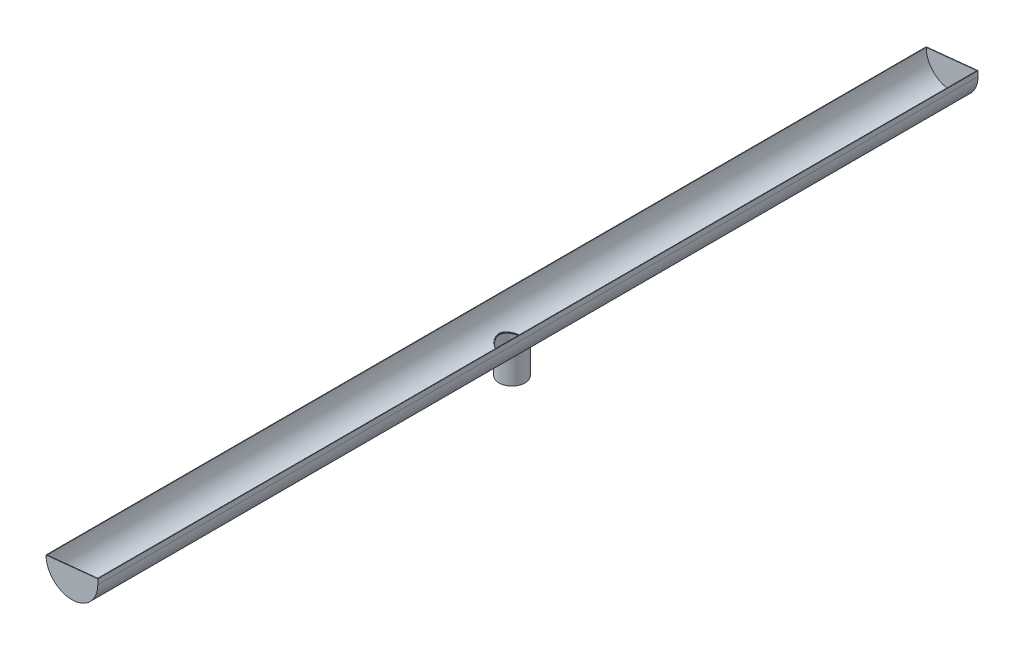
ISO-10303-21;
HEADER;
FILE_DESCRIPTION(('STEP AP214'),'2;1');
FILE_NAME('part.step','',(''),(''),'','','');
FILE_SCHEMA(('AUTOMOTIVE_DESIGN { 1 0 10303 214 1 1 1 1 }'));
ENDSEC;
DATA;
#1=APPLICATION_CONTEXT('core data for automotive mechanical design processes');
#2=APPLICATION_PROTOCOL_DEFINITION('international standard','automotive_design',2000,#1);
#3=PRODUCT_CONTEXT('',#1,'mechanical');
#4=PRODUCT('Part','Part','',(#3));
#5=PRODUCT_RELATED_PRODUCT_CATEGORY('part','',(#4));
#6=PRODUCT_DEFINITION_FORMATION('','',#4);
#7=PRODUCT_DEFINITION_CONTEXT('part definition',#1,'design');
#8=PRODUCT_DEFINITION('design','',#6,#7);
#9=PRODUCT_DEFINITION_SHAPE('','',#8);
#10=(LENGTH_UNIT() NAMED_UNIT(*) SI_UNIT(.MILLI.,.METRE.));
#11=(NAMED_UNIT(*) PLANE_ANGLE_UNIT() SI_UNIT($,.RADIAN.));
#12=(NAMED_UNIT(*) SI_UNIT($,.STERADIAN.) SOLID_ANGLE_UNIT());
#13=UNCERTAINTY_MEASURE_WITH_UNIT(LENGTH_MEASURE(1.E-05),#10,'distance_accuracy_value','');
#14=(GEOMETRIC_REPRESENTATION_CONTEXT(3) GLOBAL_UNCERTAINTY_ASSIGNED_CONTEXT((#13)) GLOBAL_UNIT_ASSIGNED_CONTEXT((#10,
#11,#12)) REPRESENTATION_CONTEXT('',''));
#15=CARTESIAN_POINT('',(0.,0.,0.));
#16=DIRECTION('',(0.,0.,1.));
#17=DIRECTION('',(1.,0.,0.));
#18=AXIS2_PLACEMENT_3D('',#15,#16,#17);
#19=CARTESIAN_POINT('',(0.,10.001,0.));
#20=DIRECTION('',(0.,-1.,0.));
#21=DIRECTION('',(0.,0.,-1.));
#22=AXIS2_PLACEMENT_3D('',#19,#20,#21);
#23=CYLINDRICAL_SURFACE('',#22,25.);
#24=CARTESIAN_POINT('',(0.,-100.,0.));
#25=DIRECTION('',(0.,1.,0.));
#26=DIRECTION('',(0.,0.,1.));
#27=AXIS2_PLACEMENT_3D('',#24,#25,#26);
#28=CIRCLE('',#27,25.);
#29=CARTESIAN_POINT('',(0.,-100.,25.));
#30=VERTEX_POINT('',#29);
#31=EDGE_CURVE('E53',#30,#30,#28,.T.);
#32=ORIENTED_EDGE('',*,*,#31,.T.);
#33=EDGE_LOOP('',(#32));
#34=FACE_BOUND('',#33,.T.);
#35=CARTESIAN_POINT('',(0.,-50.,-25.));
#36=CARTESIAN_POINT('',(-0.657444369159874,-49.9999980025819,-24.9999978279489));
#37=CARTESIAN_POINT('',(-1.31493470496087,-49.9870027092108,-24.9740362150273));
#38=CARTESIAN_POINT('',(-2.62507307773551,-49.9353488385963,-24.8704854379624));
#39=CARTESIAN_POINT('',(-3.2777188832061,-49.8966790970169,-24.7928738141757));
#40=CARTESIAN_POINT('',(-4.57408065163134,-49.7945905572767,-24.5867702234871));
#41=CARTESIAN_POINT('',(-5.21777972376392,-49.7311301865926,-24.4581927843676));
#42=CARTESIAN_POINT('',(-6.49045456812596,-49.5810908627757,-24.1516544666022));
#43=CARTESIAN_POINT('',(-7.11943180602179,-49.4945142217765,-23.9736985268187));
#44=CARTESIAN_POINT('',(-8.35617092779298,-49.3007575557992,-23.5710774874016));
#45=CARTESIAN_POINT('',(-8.96400616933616,-49.1936594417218,-23.3465978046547));
#46=CARTESIAN_POINT('',(-10.1574607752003,-48.9611646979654,-22.8526392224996));
#47=CARTESIAN_POINT('',(-10.7430796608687,-48.8357676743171,-22.5831593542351));
#48=CARTESIAN_POINT('',(-11.8888881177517,-48.5695403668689,-22.0015245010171));
#49=CARTESIAN_POINT('',(-12.4490824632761,-48.4287129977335,-21.6893775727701));
#50=CARTESIAN_POINT('',(-13.5415184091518,-48.1346789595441,-21.0246560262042));
#51=CARTESIAN_POINT('',(-14.0737590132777,-47.9814718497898,-20.672079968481));
#52=CARTESIAN_POINT('',(-15.1392859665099,-47.6563818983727,-19.9062330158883));
#53=CARTESIAN_POINT('',(-15.6706879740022,-47.4839299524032,-19.4905807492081));
#54=CARTESIAN_POINT('',(-16.6970261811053,-47.1328290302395,-18.618881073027));
#55=CARTESIAN_POINT('',(-17.1919611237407,-46.9541798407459,-18.1628322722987));
#56=CARTESIAN_POINT('',(-18.1435202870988,-46.5947579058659,-17.212353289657));
#57=CARTESIAN_POINT('',(-18.6001171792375,-46.4139837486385,-16.7178962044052));
#58=CARTESIAN_POINT('',(-19.2541986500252,-46.1446800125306,-15.9495770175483));
#59=CARTESIAN_POINT('',(-19.4670989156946,-46.0552177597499,-15.6890195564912));
#60=CARTESIAN_POINT('',(-19.8824542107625,-45.8774351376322,-15.1592003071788));
#61=CARTESIAN_POINT('',(-20.084906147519,-45.7891151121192,-14.8899359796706));
#62=CARTESIAN_POINT('',(-20.7066416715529,-45.5131934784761,-14.0272058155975));
#63=CARTESIAN_POINT('',(-21.1063416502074,-45.3287211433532,-13.4184311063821));
#64=CARTESIAN_POINT('',(-21.852630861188,-44.9736967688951,-12.165287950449));
#65=CARTESIAN_POINT('',(-22.1992234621,-44.8031438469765,-11.5209217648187));
#66=CARTESIAN_POINT('',(-22.6768446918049,-44.5622316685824,-10.5306714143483));
#67=CARTESIAN_POINT('',(-22.8290009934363,-44.4844171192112,-10.1966540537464));
#68=CARTESIAN_POINT('',(-23.1188386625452,-44.3344774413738,-9.52125737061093));
#69=CARTESIAN_POINT('',(-23.2565236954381,-44.2623508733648,-9.17987993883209));
#70=CARTESIAN_POINT('',(-23.6473153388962,-44.055551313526,-8.14540003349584));
#71=CARTESIAN_POINT('',(-23.8782374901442,-43.9304181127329,-7.44178647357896));
#72=CARTESIAN_POINT('',(-24.265648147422,-43.7175508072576,-6.05518427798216));
#73=CARTESIAN_POINT('',(-24.4257608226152,-43.6280282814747,-5.37347682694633));
#74=CARTESIAN_POINT('',(-24.6885773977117,-43.4798461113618,-3.99571637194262));
#75=CARTESIAN_POINT('',(-24.7912837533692,-43.4211851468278,-3.29966398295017));
#76=CARTESIAN_POINT('',(-24.9376202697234,-43.3373078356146,-1.89996148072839));
#77=CARTESIAN_POINT('',(-24.9813003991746,-43.3120632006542,-1.19631830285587));
#78=CARTESIAN_POINT('',(-25.0090197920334,-43.2960650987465,0.212505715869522));
#79=CARTESIAN_POINT('',(-24.9930647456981,-43.3053083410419,0.917686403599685));
#80=CARTESIAN_POINT('',(-24.907282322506,-43.3546908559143,2.23864352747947));
#81=CARTESIAN_POINT('',(-24.8441358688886,-43.3909972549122,2.85501252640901));
#82=CARTESIAN_POINT('',(-24.6726746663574,-43.4887211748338,4.07935654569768));
#83=CARTESIAN_POINT('',(-24.5643641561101,-43.5501363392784,4.68733234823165));
#84=CARTESIAN_POINT('',(-24.3037964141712,-43.696083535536,5.89108353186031));
#85=CARTESIAN_POINT('',(-24.1515281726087,-43.7806213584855,6.48685581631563));
#86=CARTESIAN_POINT('',(-23.8046322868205,-43.9702001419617,7.66258494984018));
#87=CARTESIAN_POINT('',(-23.610002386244,-44.0752421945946,8.24254095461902));
#88=CARTESIAN_POINT('',(-23.1752046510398,-44.3054368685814,9.39675041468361));
#89=CARTESIAN_POINT('',(-22.9340930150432,-44.4309962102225,9.97056645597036));
#90=CARTESIAN_POINT('',(-22.4112245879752,-44.6970138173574,11.0960462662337));
#91=CARTESIAN_POINT('',(-22.1294506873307,-44.8374783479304,11.6477005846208));
#92=CARTESIAN_POINT('',(-21.527201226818,-45.1297198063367,12.7263992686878));
#93=CARTESIAN_POINT('',(-21.2067208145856,-45.2814981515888,13.2534405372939));
#94=CARTESIAN_POINT('',(-20.5288955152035,-45.5928014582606,14.2808713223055));
#95=CARTESIAN_POINT('',(-20.1715476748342,-45.7523270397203,14.7812586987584));
#96=CARTESIAN_POINT('',(-19.3741259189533,-46.0961480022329,15.8152404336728));
#97=CARTESIAN_POINT('',(-18.9293084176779,-46.2810182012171,16.3449935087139));
#98=CARTESIAN_POINT('',(-17.9974283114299,-46.6513018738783,17.3657779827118));
#99=CARTESIAN_POINT('',(-17.5103625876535,-46.8367153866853,17.8568065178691));
#100=CARTESIAN_POINT('',(-16.496135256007,-47.2034787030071,18.797771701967));
#101=CARTESIAN_POINT('',(-15.9689550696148,-47.3848265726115,19.2476890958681));
#102=CARTESIAN_POINT('',(-14.8772179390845,-47.7388487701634,20.1034685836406));
#103=CARTESIAN_POINT('',(-14.312660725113,-47.9115230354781,20.5093303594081));
#104=CARTESIAN_POINT('',(-13.1218191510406,-48.2516201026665,21.2919897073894));
#105=CARTESIAN_POINT('',(-12.4938843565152,-48.4184234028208,21.6665521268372));
#106=CARTESIAN_POINT('',(-11.2038249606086,-48.7331003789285,22.3609230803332));
#107=CARTESIAN_POINT('',(-10.5416987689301,-48.8809731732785,22.6807290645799));
#108=CARTESIAN_POINT('',(-9.18815056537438,-49.1533730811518,23.2619857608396));
#109=CARTESIAN_POINT('',(-8.49674751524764,-49.2779150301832,23.5234735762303));
#110=CARTESIAN_POINT('',(-7.08955661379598,-49.499952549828,23.9851269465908));
#111=CARTESIAN_POINT('',(-6.37377157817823,-49.5974512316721,24.1852995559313));
#112=CARTESIAN_POINT('',(-4.98400205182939,-49.755478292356,24.5076646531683));
#113=CARTESIAN_POINT('',(-4.31146646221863,-49.8184001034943,24.6349431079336));
#114=CARTESIAN_POINT('',(-2.95626486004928,-49.9171506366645,24.8340378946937));
#115=CARTESIAN_POINT('',(-2.27359940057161,-49.9529808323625,24.9058572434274));
#116=CARTESIAN_POINT('',(-0.904053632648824,-49.9965190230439,24.9930658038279));
#117=CARTESIAN_POINT('',(-0.217175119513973,-50.0042382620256,25.0084775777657));
#118=CARTESIAN_POINT('',(1.15523822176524,-49.9913618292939,24.9827220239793));
#119=CARTESIAN_POINT('',(1.84077310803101,-49.9707674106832,24.9415572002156));
#120=CARTESIAN_POINT('',(3.15173942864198,-49.9045428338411,24.8085948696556));
#121=CARTESIAN_POINT('',(3.77770529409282,-49.8609803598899,24.7209761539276));
#122=CARTESIAN_POINT('',(5.01925848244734,-49.7513352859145,24.49907492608));
#123=CARTESIAN_POINT('',(5.63484647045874,-49.6852541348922,24.3647954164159));
#124=CARTESIAN_POINT('',(6.8517107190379,-49.5321127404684,24.0509653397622));
#125=CARTESIAN_POINT('',(7.45298618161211,-49.445051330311,23.8714122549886));
#126=CARTESIAN_POINT('',(8.63762867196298,-49.2519198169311,23.4687621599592));
#127=CARTESIAN_POINT('',(9.22099494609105,-49.1458489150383,23.2456633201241));
#128=CARTESIAN_POINT('',(10.382998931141,-48.913743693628,22.7508989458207));
#129=CARTESIAN_POINT('',(10.9610268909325,-48.7872261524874,22.4780293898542));
#130=CARTESIAN_POINT('',(12.0918113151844,-48.5193340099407,21.8905028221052));
#131=CARTESIAN_POINT('',(12.6445675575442,-48.3779592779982,21.5758454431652));
#132=CARTESIAN_POINT('',(13.7224372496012,-48.0833337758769,20.9068693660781));
#133=CARTESIAN_POINT('',(14.2475418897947,-47.930079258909,20.5525381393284));
#134=CARTESIAN_POINT('',(15.2677326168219,-47.6149288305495,19.8064580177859));
#135=CARTESIAN_POINT('',(15.7628164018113,-47.4530322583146,19.4147062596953));
#136=CARTESIAN_POINT('',(16.7680615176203,-47.1077653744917,18.5556217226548));
#137=CARTESIAN_POINT('',(17.2749260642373,-46.9238479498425,18.0846446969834));
#138=CARTESIAN_POINT('',(18.2476062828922,-46.554222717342,17.1027066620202));
#139=CARTESIAN_POINT('',(18.7134194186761,-46.368514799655,16.5917431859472));
#140=CARTESIAN_POINT('',(19.6019775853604,-45.9999341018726,15.5319295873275));
#141=CARTESIAN_POINT('',(20.0246933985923,-45.8170633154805,14.9830541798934));
#142=CARTESIAN_POINT('',(20.6242149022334,-45.5487622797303,14.1337149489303));
#143=CARTESIAN_POINT('',(20.8183024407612,-45.4603266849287,13.8462544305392));
#144=CARTESIAN_POINT('',(21.1947489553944,-45.2860424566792,13.2628494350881));
#145=CARTESIAN_POINT('',(21.3771040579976,-45.2001946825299,12.9669022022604));
#146=CARTESIAN_POINT('',(21.9230700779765,-44.9393684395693,12.0379061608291));
#147=CARTESIAN_POINT('',(22.2661651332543,-44.7698808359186,11.3910679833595));
#148=CARTESIAN_POINT('',(22.8958621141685,-44.4511441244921,10.0656627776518));
#149=CARTESIAN_POINT('',(23.1824702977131,-44.3018927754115,9.38709927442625));
#150=CARTESIAN_POINT('',(23.5674698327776,-44.0975665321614,8.34928226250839));
#151=CARTESIAN_POINT('',(23.6882891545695,-44.0327321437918,8.00011829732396));
#152=CARTESIAN_POINT('',(23.9146296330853,-43.9102159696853,7.29570214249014));
#153=CARTESIAN_POINT('',(24.0201547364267,-43.8525323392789,6.94045155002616));
#154=CARTESIAN_POINT('',(24.2155549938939,-43.7449351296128,6.2245135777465));
#155=CARTESIAN_POINT('',(24.3054305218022,-43.6950213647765,5.86382632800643));
#156=CARTESIAN_POINT('',(24.4691950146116,-43.6035233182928,5.13780554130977));
#157=CARTESIAN_POINT('',(24.5430833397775,-43.5619393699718,4.7724718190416));
#158=CARTESIAN_POINT('',(24.7276588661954,-43.4575872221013,3.74130620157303));
#159=CARTESIAN_POINT('',(24.8198883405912,-43.4048241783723,3.07101728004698));
#160=CARTESIAN_POINT('',(24.9497004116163,-43.330336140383,1.72356668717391));
#161=CARTESIAN_POINT('',(24.987286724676,-43.3086090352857,1.04640548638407));
#162=CARTESIAN_POINT('',(25.0072719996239,-43.2970726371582,-0.308775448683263));
#163=CARTESIAN_POINT('',(24.9896913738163,-43.3072515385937,-0.986794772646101));
#164=CARTESIAN_POINT('',(24.8996480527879,-43.3590845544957,-2.33793252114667));
#165=CARTESIAN_POINT('',(24.8271876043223,-43.4007373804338,-3.01105114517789));
#166=CARTESIAN_POINT('',(24.6379744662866,-43.5083984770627,-4.28290970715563));
#167=CARTESIAN_POINT('',(24.5261097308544,-43.5717024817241,-4.88261641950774));
#168=CARTESIAN_POINT('',(24.2596436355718,-43.7206240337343,-6.06956457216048));
#169=CARTESIAN_POINT('',(24.1050456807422,-43.8062398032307,-6.65680700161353));
#170=CARTESIAN_POINT('',(23.7546180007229,-43.9972486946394,-7.81567006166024));
#171=CARTESIAN_POINT('',(23.5587786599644,-44.1026464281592,-8.38728701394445));
#172=CARTESIAN_POINT('',(23.1275899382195,-44.3302828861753,-9.51195842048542));
#173=CARTESIAN_POINT('',(22.892237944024,-44.4525227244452,-10.0650116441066));
#174=CARTESIAN_POINT('',(22.3667072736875,-44.7193800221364,-11.1865646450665));
#175=CARTESIAN_POINT('',(22.0739092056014,-44.8649486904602,-11.7536103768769));
#176=CARTESIAN_POINT('',(21.4473851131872,-45.1678061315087,-12.8613635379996));
#177=CARTESIAN_POINT('',(21.1136554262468,-45.325095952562,-13.402068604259));
#178=CARTESIAN_POINT('',(20.407126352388,-45.6475630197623,-14.4551509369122));
#179=CARTESIAN_POINT('',(20.0343116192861,-45.8127433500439,-14.9675169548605));
#180=CARTESIAN_POINT('',(19.2515987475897,-46.1471242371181,-15.9617126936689));
#181=CARTESIAN_POINT('',(18.8416984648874,-46.3163250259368,-16.443540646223));
#182=CARTESIAN_POINT('',(17.9345967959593,-46.6756489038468,-17.4313764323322));
#183=CARTESIAN_POINT('',(17.43284088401,-46.8658138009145,-17.9331979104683));
#184=CARTESIAN_POINT('',(16.3875037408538,-47.2414881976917,-18.8932095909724));
#185=CARTESIAN_POINT('',(15.8439189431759,-47.4269972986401,-19.3513960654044));
#186=CARTESIAN_POINT('',(14.717334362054,-47.7885990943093,-20.2214455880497));
#187=CARTESIAN_POINT('',(14.1343114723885,-47.9646861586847,-20.6332810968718));
#188=CARTESIAN_POINT('',(12.9322386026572,-48.3026596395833,-21.4071978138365));
#189=CARTESIAN_POINT('',(12.3131907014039,-48.4645468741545,-21.7692818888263));
#190=CARTESIAN_POINT('',(11.038055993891,-48.7708340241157,-22.4429257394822));
#191=CARTESIAN_POINT('',(10.3817358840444,-48.915100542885,-22.7541055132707));
#192=CARTESIAN_POINT('',(9.04037008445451,-49.1806781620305,-23.3195507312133));
#193=CARTESIAN_POINT('',(8.35532029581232,-49.3019859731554,-23.5738080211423));
#194=CARTESIAN_POINT('',(6.96348625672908,-49.5177193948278,-24.0217187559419));
#195=CARTESIAN_POINT('',(6.25676109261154,-49.6122119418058,-24.2155232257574));
#196=CARTESIAN_POINT('',(4.82618305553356,-49.7717321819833,-24.5406902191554));
#197=CARTESIAN_POINT('',(4.10234092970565,-49.8367778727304,-24.6720908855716));
#198=CARTESIAN_POINT('',(2.815208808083,-49.9238191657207,-24.8473722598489));
#199=CARTESIAN_POINT('',(2.25412920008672,-49.9523370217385,-24.904558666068));
#200=CARTESIAN_POINT('',(1.12871107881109,-49.9904285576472,-24.9808739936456));
#201=CARTESIAN_POINT('',(0.564372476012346,-50.0000017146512,-25.0000018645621));
#202=CARTESIAN_POINT('',(0.,-50.,-25.));
#203=B_SPLINE_CURVE_WITH_KNOTS('',3,(#35,#36,#37,#38,#39,#40,#41,#42,#43,#44,#45,#46,#47,#48,
#49,#50,#51,#52,#53,#54,#55,#56,#57,#58,#59,#60,#61,#62,#63,#64,#65,#66,#67,#68,#69,#70,#71,#72,
#73,#74,#75,#76,#77,#78,#79,#80,#81,#82,#83,#84,#85,#86,#87,#88,#89,#90,#91,#92,#93,#94,#95,#96,
#97,#98,#99,#100,#101,#102,#103,#104,#105,#106,#107,#108,#109,#110,#111,#112,#113,#114,#115,
#116,#117,#118,#119,#120,#121,#122,#123,#124,#125,#126,#127,#128,#129,#130,#131,#132,#133,#134,
#135,#136,#137,#138,#139,#140,#141,#142,#143,#144,#145,#146,#147,#148,#149,#150,#151,#152,#153,
#154,#155,#156,#157,#158,#159,#160,#161,#162,#163,#164,#165,#166,#167,#168,#169,#170,#171,#172,
#173,#174,#175,#176,#177,#178,#179,#180,#181,#182,#183,#184,#185,#186,#187,#188,#189,#190,#191,
#192,#193,#194,#195,#196,#197,#198,#199,#200,#201,#202),.UNSPECIFIED.,.T.,.F.,(4,2,2,2,2,2,2,2,
2,2,2,2,2,2,2,2,2,2,2,2,2,2,2,2,2,2,2,2,2,2,2,2,2,2,2,2,2,2,2,2,2,2,2,2,2,2,2,2,2,2,2,2,2,2,2,2,
2,2,2,2,2,2,2,2,2,2,2,2,2,2,2,2,2,2,2,2,2,2,2,2,2,2,2,4),(0.,1.97177647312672,3.94441092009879,
5.92036766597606,7.89612684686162,9.86415820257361,11.8322319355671,13.7999345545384,
15.7677072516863,17.8545139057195,19.941392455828,22.0297461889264,23.0740156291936,
24.1185924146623,26.3694397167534,28.6201441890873,29.7453905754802,30.8703512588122,
33.1197167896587,35.2346267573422,37.349446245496,39.4624743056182,41.5753007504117,
43.4350827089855,45.2946901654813,47.1547637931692,49.014936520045,50.9178621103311,
52.8215907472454,54.7255582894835,56.6296784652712,58.7753747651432,60.9212295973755,
63.068084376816,65.2149546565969,67.4618500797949,69.7088501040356,71.9544164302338,
74.1997243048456,76.2590423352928,78.3182483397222,80.3766305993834,82.4349217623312,
84.3334241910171,86.231804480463,88.13029036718,90.0288560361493,91.9815881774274,
93.9343374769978,95.8877051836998,97.8412224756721,99.9866509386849,102.132211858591,
104.279217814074,105.352790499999,106.426715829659,108.678274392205,110.929583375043,
112.054588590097,113.179302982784,114.30399050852,115.428723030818,117.461588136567,
119.494314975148,121.526289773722,123.558181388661,125.396125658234,127.233923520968,
129.072150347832,130.910498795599,132.872214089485,134.834105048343,136.79676922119,
138.759546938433,140.961041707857,143.162724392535,145.365708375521,147.56856536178,
149.787182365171,152.006116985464,154.219462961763,156.431454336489,158.124047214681,
159.816686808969),.UNSPECIFIED.);
#204=CARTESIAN_POINT('',(0.,-50.,-25.));
#205=VERTEX_POINT('',#204);
#206=EDGE_CURVE('E11',#205,#205,#203,.T.);
#207=ORIENTED_EDGE('',*,*,#206,.F.);
#208=EDGE_LOOP('',(#207));
#209=FACE_BOUND('',#208,.T.);
#210=ADVANCED_FACE('F41',(#34,#209),#23,.T.);
#211=CARTESIAN_POINT('',(0.,-100.,0.));
#212=DIRECTION('',(0.,1.,0.));
#213=DIRECTION('',(0.,0.,1.));
#214=AXIS2_PLACEMENT_3D('',#211,#212,#213);
#215=PLANE('',#214);
#216=ORIENTED_EDGE('',*,*,#31,.F.);
#217=EDGE_LOOP('',(#216));
#218=FACE_BOUND('',#217,.T.);
#219=CARTESIAN_POINT('',(0.,-100.,0.));
#220=DIRECTION('',(0.,1.,0.));
#221=DIRECTION('',(0.,0.,1.));
#222=AXIS2_PLACEMENT_3D('',#219,#220,#221);
#223=CIRCLE('',#222,24.);
#224=CARTESIAN_POINT('',(0.,-100.,24.));
#225=VERTEX_POINT('',#224);
#226=EDGE_CURVE('E58',#225,#225,#223,.T.);
#227=ORIENTED_EDGE('',*,*,#226,.T.);
#228=EDGE_LOOP('',(#227));
#229=FACE_BOUND('',#228,.T.);
#230=ADVANCED_FACE('F70',(#218,#229),#215,.F.);
#231=CARTESIAN_POINT('',(0.,10.001,0.));
#232=DIRECTION('',(0.,-1.,0.));
#233=DIRECTION('',(0.,0.,-1.));
#234=AXIS2_PLACEMENT_3D('',#231,#232,#233);
#235=CYLINDRICAL_SURFACE('',#234,24.);
#236=ORIENTED_EDGE('',*,*,#226,.F.);
#237=EDGE_LOOP('',(#236));
#238=FACE_BOUND('',#237,.T.);
#239=CARTESIAN_POINT('',(0.,-50.,-24.));
#240=CARTESIAN_POINT('',(-0.634143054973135,-49.9999967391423,-23.9999962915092));
#241=CARTESIAN_POINT('',(-1.26837464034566,-49.9879062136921,-23.9748358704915));
#242=CARTESIAN_POINT('',(-2.53220578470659,-49.9398456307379,-23.8744649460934));
#243=CARTESIAN_POINT('',(-3.16180294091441,-49.9038639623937,-23.7992301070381));
#244=CARTESIAN_POINT('',(-4.41255234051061,-49.8088691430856,-23.5993895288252));
#245=CARTESIAN_POINT('',(-5.03368665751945,-49.7498131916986,-23.4746920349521));
#246=CARTESIAN_POINT('',(-6.26179118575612,-49.6101997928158,-23.1773409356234));
#247=CARTESIAN_POINT('',(-6.86876300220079,-49.5296447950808,-23.0046927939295));
#248=CARTESIAN_POINT('',(-8.0623412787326,-49.3493829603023,-22.6139670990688));
#249=CARTESIAN_POINT('',(-8.6490162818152,-49.2497499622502,-22.3960644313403));
#250=CARTESIAN_POINT('',(-9.80092326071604,-49.033512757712,-21.9164589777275));
#251=CARTESIAN_POINT('',(-10.3661546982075,-48.9169081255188,-21.6547550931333));
#252=CARTESIAN_POINT('',(-11.4719850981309,-48.669441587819,-21.0897843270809));
#253=CARTESIAN_POINT('',(-12.0125898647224,-48.5385830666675,-20.7865273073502));
#254=CARTESIAN_POINT('',(-13.0666856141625,-48.2654971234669,-20.1406023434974));
#255=CARTESIAN_POINT('',(-13.5801756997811,-48.1232693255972,-19.797933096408));
#256=CARTESIAN_POINT('',(-14.606198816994,-47.8221795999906,-19.0547312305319));
#257=CARTESIAN_POINT('',(-15.1170065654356,-47.6628316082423,-18.6520129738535));
#258=CARTESIAN_POINT('',(-16.1033150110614,-47.3387026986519,-17.8074373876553));
#259=CARTESIAN_POINT('',(-16.5788145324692,-47.173921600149,-17.3655787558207));
#260=CARTESIAN_POINT('',(-17.4924443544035,-46.8428286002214,-16.4449124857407));
#261=CARTESIAN_POINT('',(-17.9305586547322,-46.6765160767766,-15.9660891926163));
#262=CARTESIAN_POINT('',(-18.7671947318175,-46.3464643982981,-14.9737701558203));
#263=CARTESIAN_POINT('',(-19.1656970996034,-46.1827265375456,-14.4602576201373));
#264=CARTESIAN_POINT('',(-19.9471674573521,-45.8508795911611,-13.3639387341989));
#265=CARTESIAN_POINT('',(-20.3270822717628,-45.6832702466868,-12.7787985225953));
#266=CARTESIAN_POINT('',(-21.0357285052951,-45.3613225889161,-11.5752131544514));
#267=CARTESIAN_POINT('',(-21.3644853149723,-45.2069777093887,-10.9567847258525));
#268=CARTESIAN_POINT('',(-21.968024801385,-44.9167903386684,-9.69009317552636));
#269=CARTESIAN_POINT('',(-22.2428204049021,-44.7809434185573,-9.04183724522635));
#270=CARTESIAN_POINT('',(-22.7355235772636,-44.5328213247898,-7.71968334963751));
#271=CARTESIAN_POINT('',(-22.9534369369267,-44.4205437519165,-7.04578800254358));
#272=CARTESIAN_POINT('',(-23.3187594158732,-44.2298030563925,-5.71687272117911));
#273=CARTESIAN_POINT('',(-23.469502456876,-44.1497666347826,-5.06299603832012));
#274=CARTESIAN_POINT('',(-23.7159803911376,-44.0178589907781,-3.74212794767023));
#275=CARTESIAN_POINT('',(-23.8117174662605,-43.9659866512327,-3.07513706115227));
#276=CARTESIAN_POINT('',(-23.946731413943,-43.8925960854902,-1.73428710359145));
#277=CARTESIAN_POINT('',(-23.9860496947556,-43.8710555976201,-1.06043343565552));
#278=CARTESIAN_POINT('',(-24.0077418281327,-43.8591899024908,0.288439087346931));
#279=CARTESIAN_POINT('',(-23.990120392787,-43.8688621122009,0.963457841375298));
#280=CARTESIAN_POINT('',(-23.903212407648,-43.9162661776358,2.23559746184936));
#281=CARTESIAN_POINT('',(-23.8397229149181,-43.9508484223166,2.8332435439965));
#282=CARTESIAN_POINT('',(-23.6684788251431,-44.0433034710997,4.02027872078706));
#283=CARTESIAN_POINT('',(-23.560727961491,-44.1011743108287,4.60966850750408));
#284=CARTESIAN_POINT('',(-23.3021367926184,-44.2383519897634,5.776471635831));
#285=CARTESIAN_POINT('',(-23.151287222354,-44.3176634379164,6.35388237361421));
#286=CARTESIAN_POINT('',(-22.8080223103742,-44.4952965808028,7.49320639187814));
#287=CARTESIAN_POINT('',(-22.6156049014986,-44.5936192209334,8.05511890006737));
#288=CARTESIAN_POINT('',(-22.1860284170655,-44.8089181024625,9.17316707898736));
#289=CARTESIAN_POINT('',(-21.9479434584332,-44.9262708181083,9.72887385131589));
#290=CARTESIAN_POINT('',(-21.4318452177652,-45.1747498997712,10.8184844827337));
#291=CARTESIAN_POINT('',(-21.1538149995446,-45.3058821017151,11.3523789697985));
#292=CARTESIAN_POINT('',(-20.5597389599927,-45.5785467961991,12.3958718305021));
#293=CARTESIAN_POINT('',(-20.2436883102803,-45.7200806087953,12.9054671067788));
#294=CARTESIAN_POINT('',(-19.5754036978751,-46.010175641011,13.8982623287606));
#295=CARTESIAN_POINT('',(-19.2231670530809,-46.1587373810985,14.3814603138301));
#296=CARTESIAN_POINT('',(-18.4414826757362,-46.4769807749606,15.3738573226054));
#297=CARTESIAN_POINT('',(-18.0078168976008,-46.6471170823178,15.8795950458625));
#298=CARTESIAN_POINT('',(-17.0999794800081,-46.9875059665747,16.8533032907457));
#299=CARTESIAN_POINT('',(-16.625805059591,-47.1577585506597,17.3212712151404));
#300=CARTESIAN_POINT('',(-15.6391581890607,-47.4940884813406,18.2170481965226));
#301=CARTESIAN_POINT('',(-15.126670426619,-47.6601641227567,18.6448410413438));
#302=CARTESIAN_POINT('',(-14.0661237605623,-47.9838674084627,19.4573999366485));
#303=CARTESIAN_POINT('',(-13.5180647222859,-48.1414950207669,19.842165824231));
#304=CARTESIAN_POINT('',(-12.3667023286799,-48.4503233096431,20.5803469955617));
#305=CARTESIAN_POINT('',(-11.762068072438,-48.601017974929,20.9319033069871));
#306=CARTESIAN_POINT('',(-10.5210602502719,-48.8846845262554,21.5823553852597));
#307=CARTESIAN_POINT('',(-9.88468539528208,-49.0176556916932,21.8812490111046));
#308=CARTESIAN_POINT('',(-8.58493804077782,-49.2619098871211,22.4230736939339));
#309=CARTESIAN_POINT('',(-7.92158172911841,-49.3732056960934,22.6660377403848));
#310=CARTESIAN_POINT('',(-6.5726304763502,-49.5708078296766,23.0933089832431));
#311=CARTESIAN_POINT('',(-5.88703787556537,-49.6571167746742,23.2776223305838));
#312=CARTESIAN_POINT('',(-4.55379628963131,-49.7963494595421,23.5731201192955));
#313=CARTESIAN_POINT('',(-3.90738134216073,-49.8513586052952,23.6889016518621));
#314=CARTESIAN_POINT('',(-2.60561373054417,-49.9363204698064,23.8671799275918));
#315=CARTESIAN_POINT('',(-1.95026152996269,-49.9662744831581,23.9296794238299));
#316=CARTESIAN_POINT('',(-0.636202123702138,-50.0002709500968,24.0005845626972));
#317=CARTESIAN_POINT('',(0.0225038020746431,-50.0043226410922,24.0090094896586));
#318=CARTESIAN_POINT('',(1.33801164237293,-49.9864219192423,23.9717053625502));
#319=CARTESIAN_POINT('',(1.99481362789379,-49.9644704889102,23.9259783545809));
#320=CARTESIAN_POINT('',(3.2551680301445,-49.8976333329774,23.7860726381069));
#321=CARTESIAN_POINT('',(3.85921948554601,-49.8544673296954,23.6955238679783));
#322=CARTESIAN_POINT('',(5.05684375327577,-49.7472586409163,23.4691219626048));
#323=CARTESIAN_POINT('',(5.65041717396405,-49.68321717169,23.333271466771));
#324=CARTESIAN_POINT('',(6.82331158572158,-49.5357633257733,23.0176302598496));
#325=CARTESIAN_POINT('',(7.40263172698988,-49.4523497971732,22.8378369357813));
#326=CARTESIAN_POINT('',(8.54355671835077,-49.2680588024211,22.4359863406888));
#327=CARTESIAN_POINT('',(9.1051608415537,-49.167180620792,22.2139273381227));
#328=CARTESIAN_POINT('',(10.2241096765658,-48.946934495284,21.7221583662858));
#329=CARTESIAN_POINT('',(10.7808229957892,-48.8271032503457,21.4512203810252));
#330=CARTESIAN_POINT('',(11.8693061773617,-48.5739832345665,20.8686525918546));
#331=CARTESIAN_POINT('',(12.4010757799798,-48.4406943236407,20.557022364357));
#332=CARTESIAN_POINT('',(13.4373341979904,-48.1635321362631,19.8951292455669));
#333=CARTESIAN_POINT('',(13.9418139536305,-48.0196553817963,19.5448536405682));
#334=CARTESIAN_POINT('',(14.9211236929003,-47.7244349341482,18.8078624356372));
#335=CARTESIAN_POINT('',(15.3959512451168,-47.5730906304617,18.4211438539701));
#336=CARTESIAN_POINT('',(16.3562276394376,-47.2520174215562,17.5761102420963));
#337=CARTESIAN_POINT('',(16.8386279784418,-47.0818789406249,17.1144814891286));
#338=CARTESIAN_POINT('',(17.7632272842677,-46.7408880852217,16.1527939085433));
#339=CARTESIAN_POINT('',(18.205423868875,-46.5700356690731,15.652732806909));
#340=CARTESIAN_POINT('',(19.0473551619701,-46.2320680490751,14.6165660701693));
#341=CARTESIAN_POINT('',(19.4470760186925,-46.0649540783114,14.0804487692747));
#342=CARTESIAN_POINT('',(20.201623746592,-45.7390796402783,12.9746913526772));
#343=CARTESIAN_POINT('',(20.5564296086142,-45.5803231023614,12.4050357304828));
#344=CARTESIAN_POINT('',(21.2312069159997,-45.2700684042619,11.2126293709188));
#345=CARTESIAN_POINT('',(21.549299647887,-45.1190886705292,10.5886771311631));
#346=CARTESIAN_POINT('',(22.130944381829,-44.836657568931,9.31198320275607));
#347=CARTESIAN_POINT('',(22.3945267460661,-44.7051953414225,8.65925778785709));
#348=CARTESIAN_POINT('',(22.8642545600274,-44.4667885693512,7.32957315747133));
#349=CARTESIAN_POINT('',(23.0704393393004,-44.3598272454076,6.65263089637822));
#350=CARTESIAN_POINT('',(23.4228401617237,-44.1747702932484,5.27946704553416));
#351=CARTESIAN_POINT('',(23.5690645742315,-44.0966706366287,4.5832481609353));
#352=CARTESIAN_POINT('',(23.7886481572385,-43.9785654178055,3.24307921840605));
#353=CARTESIAN_POINT('',(23.8675132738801,-43.9356955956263,2.60027991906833));
#354=CARTESIAN_POINT('',(23.97301674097,-43.878219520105,1.30915583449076));
#355=CARTESIAN_POINT('',(23.9996584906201,-43.863611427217,0.660831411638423));
#356=CARTESIAN_POINT('',(24.0003349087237,-43.8632409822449,-0.635658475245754));
#357=CARTESIAN_POINT('',(23.9743846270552,-43.877470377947,-1.28382393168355));
#358=CARTESIAN_POINT('',(23.8702802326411,-43.934191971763,-2.57467894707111));
#359=CARTESIAN_POINT('',(23.7921276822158,-43.9766833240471,-3.21736866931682));
#360=CARTESIAN_POINT('',(23.5931745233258,-44.0837121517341,-4.44003859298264));
#361=CARTESIAN_POINT('',(23.4763710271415,-44.1461694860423,-5.02085905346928));
#362=CARTESIAN_POINT('',(23.2009131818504,-44.291555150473,-6.1698129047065));
#363=CARTESIAN_POINT('',(23.0422616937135,-44.3744820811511,-6.73794715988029));
#364=CARTESIAN_POINT('',(22.6845877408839,-44.5583872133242,-7.85846475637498));
#365=CARTESIAN_POINT('',(22.4855564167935,-44.6593693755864,-8.41084461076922));
#366=CARTESIAN_POINT('',(22.0488067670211,-44.8766038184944,-9.49698875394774));
#367=CARTESIAN_POINT('',(21.8110860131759,-44.9928570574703,-10.0307518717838));
#368=CARTESIAN_POINT('',(21.2815658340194,-45.2458470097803,-11.1122107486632));
#369=CARTESIAN_POINT('',(20.9872161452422,-45.3834329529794,-11.658459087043));
#370=CARTESIAN_POINT('',(20.3583695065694,-45.6689835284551,-12.7247840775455));
#371=CARTESIAN_POINT('',(20.0238549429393,-45.8169527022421,-13.2448491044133));
#372=CARTESIAN_POINT('',(19.3166097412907,-46.1195897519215,-14.2565661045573));
#373=CARTESIAN_POINT('',(18.943863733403,-46.2742603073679,-14.7482065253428));
#374=CARTESIAN_POINT('',(18.1623289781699,-46.5865520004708,-15.7006105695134));
#375=CARTESIAN_POINT('',(17.753553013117,-46.7441720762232,-16.1613850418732));
#376=CARTESIAN_POINT('',(16.8552842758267,-47.0760326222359,-17.0986941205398));
#377=CARTESIAN_POINT('',(16.3618491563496,-47.2502139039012,-17.5714810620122));
#378=CARTESIAN_POINT('',(15.3353770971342,-47.5932668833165,-18.474126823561));
#379=CARTESIAN_POINT('',(14.802336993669,-47.7621381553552,-18.9039822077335));
#380=CARTESIAN_POINT('',(13.6991648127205,-48.0901669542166,-19.7180891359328));
#381=CARTESIAN_POINT('',(13.1290122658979,-48.2493190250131,-20.1023151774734));
#382=CARTESIAN_POINT('',(11.9550795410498,-48.5535132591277,-20.8218627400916));
#383=CARTESIAN_POINT('',(11.3513015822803,-48.6985563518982,-21.1571874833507));
#384=CARTESIAN_POINT('',(10.1142728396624,-48.9704208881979,-21.7756567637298));
#385=CARTESIAN_POINT('',(9.48104728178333,-49.0972575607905,-22.0588449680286));
#386=CARTESIAN_POINT('',(8.18884234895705,-49.3292378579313,-22.5704615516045));
#387=CARTESIAN_POINT('',(7.52985918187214,-49.4343782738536,-22.7988818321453));
#388=CARTESIAN_POINT('',(6.19300443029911,-49.6195616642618,-23.1976725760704));
#389=CARTESIAN_POINT('',(5.51518649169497,-49.6996692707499,-23.3681926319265));
#390=CARTESIAN_POINT('',(4.14500977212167,-49.8326401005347,-23.6496827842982));
#391=CARTESIAN_POINT('',(3.4526606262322,-49.8855208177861,-23.7606911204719));
#392=CARTESIAN_POINT('',(2.29923401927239,-49.949207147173,-23.8940428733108));
#393=CARTESIAN_POINT('',(1.84053390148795,-49.9682290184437,-23.9337509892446));
#394=CARTESIAN_POINT('',(0.921238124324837,-49.9936267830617,-23.9867312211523));
#395=CARTESIAN_POINT('',(0.460642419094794,-50.0000023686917,-24.000002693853));
#396=CARTESIAN_POINT('',(0.,-50.,-24.));
#397=B_SPLINE_CURVE_WITH_KNOTS('',3,(#239,#240,#241,#242,#243,#244,#245,#246,#247,#248,#249,
#250,#251,#252,#253,#254,#255,#256,#257,#258,#259,#260,#261,#262,#263,#264,#265,#266,#267,#268,
#269,#270,#271,#272,#273,#274,#275,#276,#277,#278,#279,#280,#281,#282,#283,#284,#285,#286,#287,
#288,#289,#290,#291,#292,#293,#294,#295,#296,#297,#298,#299,#300,#301,#302,#303,#304,#305,#306,
#307,#308,#309,#310,#311,#312,#313,#314,#315,#316,#317,#318,#319,#320,#321,#322,#323,#324,#325,
#326,#327,#328,#329,#330,#331,#332,#333,#334,#335,#336,#337,#338,#339,#340,#341,#342,#343,#344,
#345,#346,#347,#348,#349,#350,#351,#352,#353,#354,#355,#356,#357,#358,#359,#360,#361,#362,#363,
#364,#365,#366,#367,#368,#369,#370,#371,#372,#373,#374,#375,#376,#377,#378,#379,#380,#381,#382,
#383,#384,#385,#386,#387,#388,#389,#390,#391,#392,#393,#394,#395,#396),.UNSPECIFIED.,.T.,.F.,(4,
2,2,2,2,2,2,2,2,2,2,2,2,2,2,2,2,2,2,2,2,2,2,2,2,2,2,2,2,2,2,2,2,2,2,2,2,2,2,2,2,2,2,2,2,2,2,2,2,
2,2,2,2,2,2,2,2,2,2,2,2,2,2,2,2,2,2,2,2,2,2,2,2,2,2,2,2,2,4),(0.,1.90197247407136,
3.80486996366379,5.71131401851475,7.6175409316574,9.51653394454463,11.4155745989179,
13.3141653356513,15.2128188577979,17.2197722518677,19.2267924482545,21.2346673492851,
23.2435212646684,25.3933637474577,27.5421358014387,29.6903924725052,31.8384303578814,
33.86293697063,35.8873632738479,37.9103029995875,39.9330753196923,41.7369620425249,
43.5406966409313,45.3448192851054,47.1490316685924,48.9946712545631,50.8410956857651,
52.6877548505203,54.5345509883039,56.5950493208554,58.6556892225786,60.7171571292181,
62.7786328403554,64.9222129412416,67.0658801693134,69.2082797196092,71.3504545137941,
73.3248436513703,75.2991307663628,77.2727137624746,79.2462221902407,81.0810722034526,
82.915815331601,84.7506675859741,86.5855950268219,88.4754815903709,90.3653878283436,
92.2559176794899,94.1466023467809,96.211395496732,98.2763109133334,100.341897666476,
102.408447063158,104.55494645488,106.700247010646,108.844073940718,110.987601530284,
112.932054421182,114.876380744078,116.820150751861,118.763862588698,120.549085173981,
122.334185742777,124.119678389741,125.90528313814,127.810052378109,129.715659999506,
131.622036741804,133.527739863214,135.64096329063,137.754355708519,139.868923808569,
141.98335251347,144.096002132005,146.208963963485,148.316424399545,150.42252904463,
151.804090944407,153.185686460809),.UNSPECIFIED.);
#398=CARTESIAN_POINT('',(0.,-50.,-24.));
#399=VERTEX_POINT('',#398);
#400=EDGE_CURVE('E45',#399,#399,#397,.T.);
#401=ORIENTED_EDGE('',*,*,#400,.T.);
#402=EDGE_LOOP('',(#401));
#403=FACE_BOUND('',#402,.T.);
#404=ADVANCED_FACE('F65',(#238,#403),#235,.F.);
#405=CARTESIAN_POINT('',(0.,0.,850.));
#406=DIRECTION('',(0.,0.,-1.));
#407=DIRECTION('',(-1.,0.,0.));
#408=AXIS2_PLACEMENT_3D('',#405,#406,#407);
#409=CYLINDRICAL_SURFACE('',#408,50.);
#410=ORIENTED_EDGE('',*,*,#400,.F.);
#411=EDGE_LOOP('',(#410));
#412=FACE_BOUND('',#411,.T.);
#413=ORIENTED_EDGE('',*,*,#206,.T.);
#414=EDGE_LOOP('',(#413));
#415=FACE_BOUND('',#414,.T.);
#416=ADVANCED_FACE('F62',(#412,#415),#409,.F.);
#417=CLOSED_SHELL('',(#210,#230,#404,#416));
#418=MANIFOLD_SOLID_BREP('B2',#417);
#419=CARTESIAN_POINT('',(0.,0.,850.));
#420=DIRECTION('',(0.,0.,-1.));
#421=DIRECTION('',(-1.,0.,0.));
#422=AXIS2_PLACEMENT_3D('',#419,#420,#421);
#423=CYLINDRICAL_SURFACE('',#422,49.);
#424=CARTESIAN_POINT('',(0.,-49.,25.));
#425=CARTESIAN_POINT('',(-0.655819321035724,-48.9999990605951,24.9999990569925));
#426=CARTESIAN_POINT('',(-1.31166018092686,-48.9868038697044,24.9741654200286));
#427=CARTESIAN_POINT('',(-2.61849081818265,-48.9343578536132,24.8711343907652));
#428=CARTESIAN_POINT('',(-3.26947850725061,-48.8950964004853,24.7939160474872));
#429=CARTESIAN_POINT('',(-4.56245373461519,-48.7914473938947,24.5888829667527));
#430=CARTESIAN_POINT('',(-5.20442533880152,-48.7270200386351,24.4609880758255));
#431=CARTESIAN_POINT('',(-6.47366160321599,-48.5746874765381,24.1561106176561));
#432=CARTESIAN_POINT('',(-7.10092762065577,-48.4867844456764,23.9791325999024));
#433=CARTESIAN_POINT('',(-8.33424616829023,-48.290048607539,23.5787838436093));
#434=CARTESIAN_POINT('',(-8.94037299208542,-48.1813002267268,23.3555999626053));
#435=CARTESIAN_POINT('',(-10.1304721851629,-47.9451938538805,22.8645565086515));
#436=CARTESIAN_POINT('',(-10.7144441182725,-47.8178354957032,22.596696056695));
#437=CARTESIAN_POINT('',(-11.8570746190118,-47.5473916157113,22.0186212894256));
#438=CARTESIAN_POINT('',(-12.4157373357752,-47.4043086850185,21.7084139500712));
#439=CARTESIAN_POINT('',(-13.5052578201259,-47.1054898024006,21.0478956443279));
#440=CARTESIAN_POINT('',(-14.036114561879,-46.9497533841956,20.697583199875));
#441=CARTESIAN_POINT('',(-15.0998911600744,-46.6189074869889,19.9360817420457));
#442=CARTESIAN_POINT('',(-15.6308838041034,-46.4431955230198,19.5224610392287));
#443=CARTESIAN_POINT('',(-16.6565722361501,-46.0852875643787,18.6550216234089));
#444=CARTESIAN_POINT('',(-17.1512667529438,-45.9030913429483,18.2012015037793));
#445=CARTESIAN_POINT('',(-18.1025858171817,-45.5363196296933,17.2553335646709));
#446=CARTESIAN_POINT('',(-18.5591820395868,-45.3517424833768,16.7632578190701));
#447=CARTESIAN_POINT('',(-19.2134744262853,-45.0765842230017,15.9985930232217));
#448=CARTESIAN_POINT('',(-19.4264803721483,-44.9851453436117,15.7392674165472));
#449=CARTESIAN_POINT('',(-19.8421235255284,-44.8033658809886,15.2119320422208));
#450=CARTESIAN_POINT('',(-20.0447576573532,-44.7130256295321,14.943919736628));
#451=CARTESIAN_POINT('',(-20.6687957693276,-44.4299492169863,14.0829533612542));
#452=CARTESIAN_POINT('',(-21.0705800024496,-44.2403062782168,13.4745645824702));
#453=CARTESIAN_POINT('',(-21.8210582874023,-43.8750009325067,12.2218819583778));
#454=CARTESIAN_POINT('',(-22.169755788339,-43.6993376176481,11.5775904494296));
#455=CARTESIAN_POINT('',(-22.6505335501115,-43.4509591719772,10.5871632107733));
#456=CARTESIAN_POINT('',(-22.803741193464,-43.3706895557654,10.2530404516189));
#457=CARTESIAN_POINT('',(-23.0956760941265,-43.2159346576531,9.57732748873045));
#458=CARTESIAN_POINT('',(-23.2344070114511,-43.1414479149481,9.23573919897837));
#459=CARTESIAN_POINT('',(-23.6283167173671,-42.9277548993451,8.20045933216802));
#460=CARTESIAN_POINT('',(-23.8612938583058,-42.7982732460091,7.49608540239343));
#461=CARTESIAN_POINT('',(-24.2523660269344,-42.5778119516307,6.10824291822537));
#462=CARTESIAN_POINT('',(-24.4141501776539,-42.4849712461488,5.42610369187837));
#463=CARTESIAN_POINT('',(-24.6802293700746,-42.3309582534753,4.04711629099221));
#464=CARTESIAN_POINT('',(-24.7845269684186,-42.2697845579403,3.35026877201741));
#465=CARTESIAN_POINT('',(-24.9338863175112,-42.1818547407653,1.94872931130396));
#466=CARTESIAN_POINT('',(-24.9790020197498,-42.1550672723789,1.24404510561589));
#467=CARTESIAN_POINT('',(-25.0093971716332,-42.1370435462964,-0.16703706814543));
#468=CARTESIAN_POINT('',(-24.9946827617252,-42.1458036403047,-0.873434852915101));
#469=CARTESIAN_POINT('',(-24.9113173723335,-42.1951191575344,-2.19234130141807));
#470=CARTESIAN_POINT('',(-24.8496951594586,-42.2315297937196,-2.80546645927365));
#471=CARTESIAN_POINT('',(-24.6817716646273,-42.3298904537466,-4.02342761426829));
#472=CARTESIAN_POINT('',(-24.5754748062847,-42.3918379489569,-4.62826442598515));
#473=CARTESIAN_POINT('',(-24.3194216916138,-42.5392464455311,-5.82587812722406));
#474=CARTESIAN_POINT('',(-24.1696536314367,-42.6247138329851,-6.41865169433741));
#475=CARTESIAN_POINT('',(-23.8282456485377,-42.8165037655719,-7.58854876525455));
#476=CARTESIAN_POINT('',(-23.6366034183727,-42.922827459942,-8.16567140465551));
#477=CARTESIAN_POINT('',(-23.2083660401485,-43.1559089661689,-9.31428939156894));
#478=CARTESIAN_POINT('',(-22.9708437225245,-43.2830782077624,-9.8853547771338));
#479=CARTESIAN_POINT('',(-22.4556578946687,-43.5525881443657,-11.0056229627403));
#480=CARTESIAN_POINT('',(-22.1779775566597,-43.6949351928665,-11.5548164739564));
#481=CARTESIAN_POINT('',(-21.5843948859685,-43.9911797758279,-12.6289540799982));
#482=CARTESIAN_POINT('',(-21.268487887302,-44.1450787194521,-13.1538952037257));
#483=CARTESIAN_POINT('',(-20.6002524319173,-44.4608386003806,-14.1775625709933));
#484=CARTESIAN_POINT('',(-20.2479209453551,-44.6227001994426,-14.6762866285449));
#485=CARTESIAN_POINT('',(-19.4593893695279,-44.9726812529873,-15.7101586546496));
#486=CARTESIAN_POINT('',(-19.0182654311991,-45.1614327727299,-16.2413459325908));
#487=CARTESIAN_POINT('',(-18.0937648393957,-45.5397094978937,-17.2653281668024));
#488=CARTESIAN_POINT('',(-17.6103849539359,-45.7292347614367,-17.7581201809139));
#489=CARTESIAN_POINT('',(-16.6034432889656,-46.1043862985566,-18.7030092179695));
#490=CARTESIAN_POINT('',(-16.0798614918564,-46.2900105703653,-19.15508572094));
#491=CARTESIAN_POINT('',(-14.9951720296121,-46.6526722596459,-20.0155958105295));
#492=CARTESIAN_POINT('',(-14.4340640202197,-46.8297095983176,-20.4240289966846));
#493=CARTESIAN_POINT('',(-13.2478611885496,-47.1793959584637,-21.2138411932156));
#494=CARTESIAN_POINT('',(-12.6209670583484,-47.3513750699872,-21.5928221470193));
#495=CARTESIAN_POINT('',(-11.3323933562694,-47.6761815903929,-22.2960890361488));
#496=CARTESIAN_POINT('',(-10.6707120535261,-47.8290080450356,-22.6203722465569));
#497=CARTESIAN_POINT('',(-9.31742939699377,-48.1109429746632,-23.2105583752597));
#498=CARTESIAN_POINT('',(-8.62584813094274,-48.2400670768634,-23.4764997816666));
#499=CARTESIAN_POINT('',(-7.21764815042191,-48.4707576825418,-23.9469503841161));
#500=CARTESIAN_POINT('',(-6.50103246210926,-48.5723275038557,-24.1514669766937));
#501=CARTESIAN_POINT('',(-5.11068486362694,-48.7373424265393,-24.481567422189));
#502=CARTESIAN_POINT('',(-4.43849032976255,-48.8032955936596,-24.6123856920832));
#503=CARTESIAN_POINT('',(-3.08352825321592,-48.9076006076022,-24.8185685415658));
#504=CARTESIAN_POINT('',(-2.40076130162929,-48.9459539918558,-24.8939362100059));
#505=CARTESIAN_POINT('',(-1.03062445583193,-48.9939540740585,-24.9881807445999));
#506=CARTESIAN_POINT('',(-0.343256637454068,-49.003612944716,-25.0070815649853));
#507=CARTESIAN_POINT('',(1.03047975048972,-48.9939774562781,-24.9881954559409));
#508=CARTESIAN_POINT('',(1.71684836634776,-48.9746844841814,-24.9504112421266));
#509=CARTESIAN_POINT('',(3.02699785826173,-48.9104471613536,-24.8240704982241));
#510=CARTESIAN_POINT('',(3.65131788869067,-48.867723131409,-24.739906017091));
#511=CARTESIAN_POINT('',(4.88985815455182,-48.7593648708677,-24.5251760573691));
#512=CARTESIAN_POINT('',(5.50407906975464,-48.6937321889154,-24.3946137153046));
#513=CARTESIAN_POINT('',(6.71848440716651,-48.541081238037,-24.0884652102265));
#514=CARTESIAN_POINT('',(7.31866806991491,-48.4540618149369,-23.9128766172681));
#515=CARTESIAN_POINT('',(8.50140413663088,-48.2605974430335,-23.5183927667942));
#516=CARTESIAN_POINT('',(9.08395579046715,-48.1541516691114,-23.2994956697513));
#517=CARTESIAN_POINT('',(10.2440529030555,-47.9209665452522,-22.8137168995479));
#518=CARTESIAN_POINT('',(10.8210170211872,-47.7937484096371,-22.5456781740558));
#519=CARTESIAN_POINT('',(11.9500382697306,-47.5240308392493,-21.9681291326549));
#520=CARTESIAN_POINT('',(12.5020952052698,-47.381531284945,-21.658618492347));
#521=CARTESIAN_POINT('',(13.5789575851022,-47.0842227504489,-21.0002455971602));
#522=CARTESIAN_POINT('',(14.1037546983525,-46.9294100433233,-20.651371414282));
#523=CARTESIAN_POINT('',(15.1237738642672,-46.6106967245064,-19.9164923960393));
#524=CARTESIAN_POINT('',(15.6189935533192,-46.4467953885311,-19.5304845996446));
#525=CARTESIAN_POINT('',(16.6264867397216,-46.0963385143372,-18.6825108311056));
#526=CARTESIAN_POINT('',(17.1354099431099,-45.909169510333,-18.2168112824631));
#527=CARTESIAN_POINT('',(18.1126516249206,-45.5324739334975,-17.245480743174));
#528=CARTESIAN_POINT('',(18.5809675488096,-45.3429472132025,-16.7398472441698));
#529=CARTESIAN_POINT('',(19.4750708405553,-44.966177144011,-15.6906621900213));
#530=CARTESIAN_POINT('',(19.9008265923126,-44.7789355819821,-15.1470829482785));
#531=CARTESIAN_POINT('',(20.5053349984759,-44.5037112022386,-14.3056128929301));
#532=CARTESIAN_POINT('',(20.7011561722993,-44.4129064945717,-14.0207628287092));
#533=CARTESIAN_POINT('',(21.081219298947,-44.2337691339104,-13.4425417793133));
#534=CARTESIAN_POINT('',(21.2654574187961,-44.1454373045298,-13.1491680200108));
#535=CARTESIAN_POINT('',(21.8194583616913,-43.8758001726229,-12.2247849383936));
#536=CARTESIAN_POINT('',(22.1686935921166,-43.6998789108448,-11.579708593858));
#537=CARTESIAN_POINT('',(22.8107837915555,-43.3681784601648,-10.2571092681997));
#538=CARTESIAN_POINT('',(23.1036451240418,-43.2123969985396,-9.57958996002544));
#539=CARTESIAN_POINT('',(23.4980532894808,-42.9984159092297,-8.54272926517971));
#540=CARTESIAN_POINT('',(23.6220110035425,-42.9303885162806,-8.19378853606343));
#541=CARTESIAN_POINT('',(23.8546283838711,-42.8015700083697,-7.48960116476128));
#542=CARTESIAN_POINT('',(23.9632919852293,-42.7407770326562,-7.13435617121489));
#543=CARTESIAN_POINT('',(24.1649540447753,-42.6270853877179,-6.41820572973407));
#544=CARTESIAN_POINT('',(24.2579529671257,-42.574186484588,-6.05730044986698));
#545=CARTESIAN_POINT('',(24.4279318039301,-42.476884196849,-5.33061525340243));
#546=CARTESIAN_POINT('',(24.5049110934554,-42.43248114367,-4.96483514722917));
#547=CARTESIAN_POINT('',(24.6979457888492,-42.3205913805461,-3.93288238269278));
#548=CARTESIAN_POINT('',(24.7955495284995,-42.2633099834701,-3.26200805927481));
#549=CARTESIAN_POINT('',(24.9359526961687,-42.1806222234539,-1.91270801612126));
#550=CARTESIAN_POINT('',(24.9787559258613,-42.1552136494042,-1.2342828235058));
#551=CARTESIAN_POINT('',(25.0089146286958,-42.1373292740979,0.123970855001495));
#552=CARTESIAN_POINT('',(24.9962935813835,-42.1448395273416,0.803798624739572));
#553=CARTESIAN_POINT('',(24.9158477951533,-42.192448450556,2.15899451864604));
#554=CARTESIAN_POINT('',(24.8480256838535,-42.2325455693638,2.83436285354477));
#555=CARTESIAN_POINT('',(24.6680423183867,-42.3378935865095,4.10565476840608));
#556=CARTESIAN_POINT('',(24.5611733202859,-42.4001249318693,4.70259023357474));
#557=CARTESIAN_POINT('',(24.3051351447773,-42.5474112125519,5.8843780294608));
#558=CARTESIAN_POINT('',(24.155969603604,-42.6324641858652,6.46923139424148));
#559=CARTESIAN_POINT('',(23.8168238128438,-42.8228521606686,7.62371336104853));
#560=CARTESIAN_POINT('',(23.6268336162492,-42.928192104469,8.19333821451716));
#561=CARTESIAN_POINT('',(23.2077450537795,-43.156198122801,9.31443836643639));
#562=CARTESIAN_POINT('',(22.9786440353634,-43.2788653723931,9.8659124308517));
#563=CARTESIAN_POINT('',(22.4665351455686,-43.5470295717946,10.9844416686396));
#564=CARTESIAN_POINT('',(22.1809508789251,-43.6935035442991,11.5500825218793));
#565=CARTESIAN_POINT('',(21.5692995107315,-43.998660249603,12.6556108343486));
#566=CARTESIAN_POINT('',(21.2432286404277,-44.1573441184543,13.1954958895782));
#567=CARTESIAN_POINT('',(20.5524283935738,-44.4830702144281,14.2475916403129));
#568=CARTESIAN_POINT('',(20.187683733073,-44.6501157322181,14.7597912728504));
#569=CARTESIAN_POINT('',(19.4214703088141,-44.988686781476,15.7543843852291));
#570=CARTESIAN_POINT('',(19.0199993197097,-45.1602125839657,16.2367760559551));
#571=CARTESIAN_POINT('',(18.1282076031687,-45.5261374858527,17.2298820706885));
#572=CARTESIAN_POINT('',(17.633099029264,-45.7206432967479,17.7362694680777));
#573=CARTESIAN_POINT('',(16.6008140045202,-46.1054924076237,18.7060026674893));
#574=CARTESIAN_POINT('',(16.0636338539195,-46.2958353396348,19.1693446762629));
#575=CARTESIAN_POINT('',(14.949508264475,-46.6675177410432,20.0503572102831));
#576=CARTESIAN_POINT('',(14.3725386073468,-46.8488516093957,20.4679995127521));
#577=CARTESIAN_POINT('',(13.1821065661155,-47.1976343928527,21.2541951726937));
#578=CARTESIAN_POINT('',(12.5686461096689,-47.3650840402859,21.6227511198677));
#579=CARTESIAN_POINT('',(11.3011403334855,-47.6835001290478,22.3116700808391));
#580=CARTESIAN_POINT('',(10.646699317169,-47.8342470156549,22.6314082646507));
#581=CARTESIAN_POINT('',(9.30808805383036,-48.1126469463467,23.2140545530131));
#582=CARTESIAN_POINT('',(8.62391362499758,-48.2402967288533,23.4769546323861));
#583=CARTESIAN_POINT('',(7.23272889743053,-48.4683734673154,23.9421015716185));
#584=CARTESIAN_POINT('',(6.52577918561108,-48.5688668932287,24.1444966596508));
#585=CARTESIAN_POINT('',(5.09368334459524,-48.7398587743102,24.4866465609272));
#586=CARTESIAN_POINT('',(4.36854829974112,-48.8103750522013,24.6264385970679));
#587=CARTESIAN_POINT('',(3.03665615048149,-48.9095299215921,24.8223243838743));
#588=CARTESIAN_POINT('',(2.43180310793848,-48.9433885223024,24.8888872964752));
#589=CARTESIAN_POINT('',(1.2179729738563,-48.9886242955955,24.9777261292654));
#590=CARTESIAN_POINT('',(0.608995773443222,-49.0000008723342,25.0000008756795));
#591=CARTESIAN_POINT('',(0.,-49.,25.));
#592=B_SPLINE_CURVE_WITH_KNOTS('',3,(#424,#425,#426,#427,#428,#429,#430,#431,#432,#433,#434,
#435,#436,#437,#438,#439,#440,#441,#442,#443,#444,#445,#446,#447,#448,#449,#450,#451,#452,#453,
#454,#455,#456,#457,#458,#459,#460,#461,#462,#463,#464,#465,#466,#467,#468,#469,#470,#471,#472,
#473,#474,#475,#476,#477,#478,#479,#480,#481,#482,#483,#484,#485,#486,#487,#488,#489,#490,#491,
#492,#493,#494,#495,#496,#497,#498,#499,#500,#501,#502,#503,#504,#505,#506,#507,#508,#509,#510,
#511,#512,#513,#514,#515,#516,#517,#518,#519,#520,#521,#522,#523,#524,#525,#526,#527,#528,#529,
#530,#531,#532,#533,#534,#535,#536,#537,#538,#539,#540,#541,#542,#543,#544,#545,#546,#547,#548,
#549,#550,#551,#552,#553,#554,#555,#556,#557,#558,#559,#560,#561,#562,#563,#564,#565,#566,#567,
#568,#569,#570,#571,#572,#573,#574,#575,#576,#577,#578,#579,#580,#581,#582,#583,#584,#585,#586,
#587,#588,#589,#590,#591),.UNSPECIFIED.,.T.,.F.,(4,2,2,2,2,2,2,2,2,2,2,2,2,2,2,2,2,2,2,2,2,2,2,
2,2,2,2,2,2,2,2,2,2,2,2,2,2,2,2,2,2,2,2,2,2,2,2,2,2,2,2,2,2,2,2,2,2,2,2,2,2,2,2,2,2,2,2,2,2,2,2,
2,2,2,2,2,2,2,2,2,2,2,2,4),(0.,1.96685862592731,3.93451968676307,5.90530543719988,
7.87590857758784,9.8386929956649,11.8015160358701,13.7640161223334,15.7265885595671,
17.8112863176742,19.8960570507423,21.9823641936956,23.0256107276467,24.0691648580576,
26.3262585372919,28.5832055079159,29.7115617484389,30.8396320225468,33.0952020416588,
35.2137533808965,37.3322104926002,39.4487350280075,41.5650423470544,43.4147260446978,
45.2642266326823,47.1142298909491,48.9643351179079,50.8567181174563,52.7498964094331,
54.6433060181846,56.5368732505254,58.681952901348,60.8271967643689,62.9735158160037,
65.1198545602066,67.3742756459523,69.6288090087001,71.8818505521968,74.1346206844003,
76.1957642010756,78.2567928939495,80.3169471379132,82.3770026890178,84.2690503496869,
86.1609701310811,88.0529920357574,89.9450943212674,91.8893883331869,93.8336975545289,
95.7785975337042,97.7236527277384,99.865649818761,102.007781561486,104.151492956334,
105.223419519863,106.295698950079,108.555613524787,110.815272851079,111.944412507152,
113.073261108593,114.202076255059,115.330935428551,117.368837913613,119.406599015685,
121.443496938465,123.480297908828,125.307105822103,127.133756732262,128.960853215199,
130.788073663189,132.73717389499,134.686455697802,136.636510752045,138.586684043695,
140.787475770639,142.988461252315,145.190798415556,147.393019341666,149.621413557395,
151.850122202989,154.073325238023,156.295204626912,158.121586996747,159.948017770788),.UNSPECIFIED.);
#593=CARTESIAN_POINT('',(0.,-49.,25.));
#594=VERTEX_POINT('',#593);
#595=EDGE_CURVE('E292',#594,#594,#592,.T.);
#596=ORIENTED_EDGE('',*,*,#595,.T.);
#597=EDGE_LOOP('',(#596));
#598=FACE_BOUND('',#597,.T.);
#599=DIRECTION('',(0.,0.,-1.));
#600=VECTOR('',#599,1.);
#601=CARTESIAN_POINT('',(49.,0.,850.));
#602=LINE('',#601,#600);
#603=CARTESIAN_POINT('',(49.,0.,849.));
#604=VERTEX_POINT('',#603);
#605=CARTESIAN_POINT('',(49.,0.,-849.));
#606=VERTEX_POINT('',#605);
#607=EDGE_CURVE('E191',#604,#606,#602,.T.);
#608=ORIENTED_EDGE('',*,*,#607,.T.);
#609=CARTESIAN_POINT('',(0.,0.,-849.));
#610=DIRECTION('',(0.,0.,1.));
#611=DIRECTION('',(1.,0.,0.));
#612=AXIS2_PLACEMENT_3D('',#609,#610,#611);
#613=CIRCLE('',#612,49.);
#614=CARTESIAN_POINT('',(-49.,0.,-849.));
#615=VERTEX_POINT('',#614);
#616=EDGE_CURVE('E137',#615,#606,#613,.T.);
#617=ORIENTED_EDGE('',*,*,#616,.F.);
#618=DIRECTION('',(0.,0.,-1.));
#619=VECTOR('',#618,1.);
#620=CARTESIAN_POINT('',(-49.,0.,850.));
#621=LINE('',#620,#619);
#622=CARTESIAN_POINT('',(-49.,0.,849.));
#623=VERTEX_POINT('',#622);
#624=EDGE_CURVE('E192',#623,#615,#621,.T.);
#625=ORIENTED_EDGE('',*,*,#624,.F.);
#626=CARTESIAN_POINT('',(0.,0.,849.));
#627=DIRECTION('',(0.,0.,1.));
#628=DIRECTION('',(1.,0.,0.));
#629=AXIS2_PLACEMENT_3D('',#626,#627,#628);
#630=CIRCLE('',#629,49.);
#631=EDGE_CURVE('E186',#623,#604,#630,.T.);
#632=ORIENTED_EDGE('',*,*,#631,.T.);
#633=EDGE_LOOP('',(#608,#617,#625,#632));
#634=FACE_BOUND('',#633,.T.);
#635=ADVANCED_FACE('F111',(#598,#634),#423,.F.);
#636=CARTESIAN_POINT('',(49.,0.,850.));
#637=DIRECTION('',(1.,0.,0.));
#638=DIRECTION('',(0.,0.,-1.));
#639=AXIS2_PLACEMENT_3D('',#636,#637,#638);
#640=PLANE('',#639);
#641=DIRECTION('',(0.,0.,-1.));
#642=VECTOR('',#641,1.);
#643=CARTESIAN_POINT('',(49.,10.,850.));
#644=LINE('',#643,#642);
#645=CARTESIAN_POINT('',(49.,10.,849.));
#646=VERTEX_POINT('',#645);
#647=CARTESIAN_POINT('',(49.,10.,-849.));
#648=VERTEX_POINT('',#647);
#649=EDGE_CURVE('E197',#646,#648,#644,.T.);
#650=ORIENTED_EDGE('',*,*,#649,.T.);
#651=DIRECTION('',(0.,1.,0.));
#652=VECTOR('',#651,1.);
#653=CARTESIAN_POINT('',(49.,0.,-849.));
#654=LINE('',#653,#652);
#655=EDGE_CURVE('E130',#606,#648,#654,.T.);
#656=ORIENTED_EDGE('',*,*,#655,.F.);
#657=ORIENTED_EDGE('',*,*,#607,.F.);
#658=DIRECTION('',(0.,1.,0.));
#659=VECTOR('',#658,1.);
#660=CARTESIAN_POINT('',(49.,0.,849.));
#661=LINE('',#660,#659);
#662=EDGE_CURVE('E183',#604,#646,#661,.T.);
#663=ORIENTED_EDGE('',*,*,#662,.T.);
#664=EDGE_LOOP('',(#650,#656,#657,#663));
#665=FACE_BOUND('',#664,.T.);
#666=ADVANCED_FACE('F196',(#665),#640,.F.);
#667=CARTESIAN_POINT('',(-50.,0.,850.));
#668=DIRECTION('',(0.,-1.,0.));
#669=DIRECTION('',(0.,0.,-1.));
#670=AXIS2_PLACEMENT_3D('',#667,#668,#669);
#671=PLANE('',#670);
#672=DIRECTION('',(-1.,0.,0.));
#673=VECTOR('',#672,1.);
#674=CARTESIAN_POINT('',(-50.,0.,-850.));
#675=LINE('',#674,#673);
#676=CARTESIAN_POINT('',(-49.,0.,-850.));
#677=VERTEX_POINT('',#676);
#678=CARTESIAN_POINT('',(-50.,0.,-850.));
#679=VERTEX_POINT('',#678);
#680=EDGE_CURVE('E243',#677,#679,#675,.T.);
#681=ORIENTED_EDGE('',*,*,#680,.T.);
#682=DIRECTION('',(0.,0.,-1.));
#683=VECTOR('',#682,1.);
#684=CARTESIAN_POINT('',(-50.,0.,850.));
#685=LINE('',#684,#683);
#686=CARTESIAN_POINT('',(-50.,0.,850.));
#687=VERTEX_POINT('',#686);
#688=EDGE_CURVE('E215',#687,#679,#685,.T.);
#689=ORIENTED_EDGE('',*,*,#688,.F.);
#690=DIRECTION('',(-1.,0.,0.));
#691=VECTOR('',#690,1.);
#692=CARTESIAN_POINT('',(-50.,0.,850.));
#693=LINE('',#692,#691);
#694=CARTESIAN_POINT('',(-49.,0.,850.));
#695=VERTEX_POINT('',#694);
#696=EDGE_CURVE('E246',#695,#687,#693,.T.);
#697=ORIENTED_EDGE('',*,*,#696,.F.);
#698=EDGE_CURVE('E123',#695,#623,#621,.T.);
#699=ORIENTED_EDGE('',*,*,#698,.T.);
#700=ORIENTED_EDGE('',*,*,#624,.T.);
#701=DIRECTION('',(0.,0.,1.));
#702=VECTOR('',#701,1.);
#703=CARTESIAN_POINT('',(-49.,0.,-850.));
#704=LINE('',#703,#702);
#705=EDGE_CURVE('E221',#677,#615,#704,.T.);
#706=ORIENTED_EDGE('',*,*,#705,.F.);
#707=EDGE_LOOP('',(#681,#689,#697,#699,#700,#706));
#708=FACE_BOUND('',#707,.T.);
#709=ADVANCED_FACE('F220',(#708),#671,.F.);
#710=CARTESIAN_POINT('',(0.,0.,850.));
#711=DIRECTION('',(0.,0.,-1.));
#712=DIRECTION('',(-1.,0.,0.));
#713=AXIS2_PLACEMENT_3D('',#710,#711,#712);
#714=CYLINDRICAL_SURFACE('',#713,50.);
#715=CARTESIAN_POINT('',(0.,-50.,25.));
#716=CARTESIAN_POINT('',(0.657444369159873,-49.9999980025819,24.9999978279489));
#717=CARTESIAN_POINT('',(1.31493470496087,-49.9870027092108,24.9740362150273));
#718=CARTESIAN_POINT('',(2.62507307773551,-49.9353488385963,24.8704854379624));
#719=CARTESIAN_POINT('',(3.2777188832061,-49.8966790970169,24.7928738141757));
#720=CARTESIAN_POINT('',(4.57408065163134,-49.7945905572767,24.5867702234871));
#721=CARTESIAN_POINT('',(5.21777972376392,-49.7311301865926,24.4581927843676));
#722=CARTESIAN_POINT('',(6.49045456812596,-49.5810908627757,24.1516544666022));
#723=CARTESIAN_POINT('',(7.11943180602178,-49.4945142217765,23.9736985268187));
#724=CARTESIAN_POINT('',(8.35617092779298,-49.3007575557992,23.5710774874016));
#725=CARTESIAN_POINT('',(8.96400616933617,-49.1936594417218,23.3465978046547));
#726=CARTESIAN_POINT('',(10.1574607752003,-48.9611646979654,22.8526392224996));
#727=CARTESIAN_POINT('',(10.7430796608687,-48.8357676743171,22.5831593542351));
#728=CARTESIAN_POINT('',(11.8888881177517,-48.5695403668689,22.0015245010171));
#729=CARTESIAN_POINT('',(12.4490824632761,-48.4287129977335,21.6893775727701));
#730=CARTESIAN_POINT('',(13.5415184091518,-48.1346789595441,21.0246560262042));
#731=CARTESIAN_POINT('',(14.0737590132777,-47.9814718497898,20.672079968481));
#732=CARTESIAN_POINT('',(15.1392859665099,-47.6563818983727,19.9062330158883));
#733=CARTESIAN_POINT('',(15.6706879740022,-47.4839299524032,19.4905807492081));
#734=CARTESIAN_POINT('',(16.6970261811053,-47.1328290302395,18.618881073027));
#735=CARTESIAN_POINT('',(17.1919611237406,-46.9541798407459,18.1628322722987));
#736=CARTESIAN_POINT('',(18.1435202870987,-46.5947579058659,17.212353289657));
#737=CARTESIAN_POINT('',(18.6001171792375,-46.4139837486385,16.7178962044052));
#738=CARTESIAN_POINT('',(19.2541986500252,-46.1446800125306,15.9495770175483));
#739=CARTESIAN_POINT('',(19.4670989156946,-46.0552177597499,15.6890195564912));
#740=CARTESIAN_POINT('',(19.8824542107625,-45.8774351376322,15.1592003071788));
#741=CARTESIAN_POINT('',(20.084906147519,-45.7891151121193,14.8899359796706));
#742=CARTESIAN_POINT('',(20.7066416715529,-45.5131934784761,14.0272058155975));
#743=CARTESIAN_POINT('',(21.1063416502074,-45.3287211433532,13.4184311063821));
#744=CARTESIAN_POINT('',(21.852630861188,-44.9736967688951,12.165287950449));
#745=CARTESIAN_POINT('',(22.1992234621,-44.8031438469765,11.5209217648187));
#746=CARTESIAN_POINT('',(22.6768446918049,-44.5622316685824,10.5306714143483));
#747=CARTESIAN_POINT('',(22.8290009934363,-44.4844171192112,10.1966540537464));
#748=CARTESIAN_POINT('',(23.1188386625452,-44.3344774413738,9.52125737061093));
#749=CARTESIAN_POINT('',(23.2565236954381,-44.2623508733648,9.17987993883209));
#750=CARTESIAN_POINT('',(23.6473153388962,-44.055551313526,8.14540003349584));
#751=CARTESIAN_POINT('',(23.8782374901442,-43.9304181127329,7.44178647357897));
#752=CARTESIAN_POINT('',(24.265648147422,-43.7175508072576,6.05518427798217));
#753=CARTESIAN_POINT('',(24.4257608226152,-43.6280282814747,5.37347682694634));
#754=CARTESIAN_POINT('',(24.6885773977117,-43.4798461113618,3.99571637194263));
#755=CARTESIAN_POINT('',(24.7912837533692,-43.4211851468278,3.29966398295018));
#756=CARTESIAN_POINT('',(24.9376202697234,-43.3373078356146,1.8999614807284));
#757=CARTESIAN_POINT('',(24.9813003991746,-43.3120632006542,1.19631830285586));
#758=CARTESIAN_POINT('',(25.0090197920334,-43.2960650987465,-0.212505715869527));
#759=CARTESIAN_POINT('',(24.9930647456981,-43.3053083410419,-0.917686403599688));
#760=CARTESIAN_POINT('',(24.907282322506,-43.3546908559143,-2.23864352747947));
#761=CARTESIAN_POINT('',(24.8441358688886,-43.3909972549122,-2.85501252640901));
#762=CARTESIAN_POINT('',(24.6726746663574,-43.4887211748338,-4.07935654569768));
#763=CARTESIAN_POINT('',(24.5643641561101,-43.5501363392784,-4.68733234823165));
#764=CARTESIAN_POINT('',(24.3037964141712,-43.696083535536,-5.89108353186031));
#765=CARTESIAN_POINT('',(24.1515281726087,-43.7806213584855,-6.48685581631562));
#766=CARTESIAN_POINT('',(23.8046322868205,-43.9702001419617,-7.66258494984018));
#767=CARTESIAN_POINT('',(23.610002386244,-44.0752421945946,-8.24254095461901));
#768=CARTESIAN_POINT('',(23.1752046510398,-44.3054368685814,-9.3967504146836));
#769=CARTESIAN_POINT('',(22.9340930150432,-44.4309962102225,-9.97056645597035));
#770=CARTESIAN_POINT('',(22.4112245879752,-44.6970138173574,-11.0960462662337));
#771=CARTESIAN_POINT('',(22.1294506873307,-44.8374783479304,-11.6477005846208));
#772=CARTESIAN_POINT('',(21.527201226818,-45.1297198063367,-12.7263992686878));
#773=CARTESIAN_POINT('',(21.2067208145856,-45.2814981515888,-13.2534405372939));
#774=CARTESIAN_POINT('',(20.5288955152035,-45.5928014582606,-14.2808713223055));
#775=CARTESIAN_POINT('',(20.1715476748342,-45.7523270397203,-14.7812586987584));
#776=CARTESIAN_POINT('',(19.3741259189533,-46.0961480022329,-15.8152404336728));
#777=CARTESIAN_POINT('',(18.9293084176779,-46.2810182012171,-16.3449935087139));
#778=CARTESIAN_POINT('',(17.9974283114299,-46.6513018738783,-17.3657779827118));
#779=CARTESIAN_POINT('',(17.5103625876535,-46.8367153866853,-17.8568065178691));
#780=CARTESIAN_POINT('',(16.496135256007,-47.2034787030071,-18.797771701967));
#781=CARTESIAN_POINT('',(15.9689550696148,-47.3848265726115,-19.2476890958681));
#782=CARTESIAN_POINT('',(14.8772179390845,-47.7388487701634,-20.1034685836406));
#783=CARTESIAN_POINT('',(14.312660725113,-47.9115230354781,-20.5093303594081));
#784=CARTESIAN_POINT('',(13.1218191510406,-48.2516201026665,-21.2919897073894));
#785=CARTESIAN_POINT('',(12.4938843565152,-48.4184234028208,-21.6665521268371));
#786=CARTESIAN_POINT('',(11.2038249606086,-48.7331003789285,-22.3609230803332));
#787=CARTESIAN_POINT('',(10.5416987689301,-48.8809731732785,-22.6807290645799));
#788=CARTESIAN_POINT('',(9.18815056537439,-49.1533730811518,-23.2619857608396));
#789=CARTESIAN_POINT('',(8.49674751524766,-49.2779150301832,-23.5234735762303));
#790=CARTESIAN_POINT('',(7.08955661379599,-49.499952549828,-23.9851269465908));
#791=CARTESIAN_POINT('',(6.37377157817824,-49.5974512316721,-24.1852995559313));
#792=CARTESIAN_POINT('',(4.9840020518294,-49.755478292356,-24.5076646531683));
#793=CARTESIAN_POINT('',(4.31146646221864,-49.8184001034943,-24.6349431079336));
#794=CARTESIAN_POINT('',(2.9562648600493,-49.9171506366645,-24.8340378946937));
#795=CARTESIAN_POINT('',(2.27359940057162,-49.9529808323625,-24.9058572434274));
#796=CARTESIAN_POINT('',(0.904053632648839,-49.9965190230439,-24.9930658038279));
#797=CARTESIAN_POINT('',(0.217175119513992,-50.0042382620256,-25.0084775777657));
#798=CARTESIAN_POINT('',(-1.15523822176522,-49.9913618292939,-24.9827220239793));
#799=CARTESIAN_POINT('',(-1.84077310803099,-49.9707674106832,-24.9415572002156));
#800=CARTESIAN_POINT('',(-3.15173942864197,-49.9045428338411,-24.8085948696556));
#801=CARTESIAN_POINT('',(-3.77770529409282,-49.8609803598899,-24.7209761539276));
#802=CARTESIAN_POINT('',(-5.01925848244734,-49.7513352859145,-24.49907492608));
#803=CARTESIAN_POINT('',(-5.63484647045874,-49.6852541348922,-24.3647954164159));
#804=CARTESIAN_POINT('',(-6.8517107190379,-49.5321127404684,-24.0509653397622));
#805=CARTESIAN_POINT('',(-7.45298618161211,-49.445051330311,-23.8714122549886));
#806=CARTESIAN_POINT('',(-8.63762867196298,-49.2519198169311,-23.4687621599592));
#807=CARTESIAN_POINT('',(-9.22099494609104,-49.1458489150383,-23.2456633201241));
#808=CARTESIAN_POINT('',(-10.382998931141,-48.913743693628,-22.7508989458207));
#809=CARTESIAN_POINT('',(-10.9610268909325,-48.7872261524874,-22.4780293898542));
#810=CARTESIAN_POINT('',(-12.0918113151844,-48.5193340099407,-21.8905028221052));
#811=CARTESIAN_POINT('',(-12.6445675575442,-48.3779592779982,-21.5758454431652));
#812=CARTESIAN_POINT('',(-13.7224372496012,-48.0833337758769,-20.9068693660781));
#813=CARTESIAN_POINT('',(-14.2475418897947,-47.9300792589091,-20.5525381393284));
#814=CARTESIAN_POINT('',(-15.2677326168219,-47.6149288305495,-19.8064580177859));
#815=CARTESIAN_POINT('',(-15.7628164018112,-47.4530322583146,-19.4147062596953));
#816=CARTESIAN_POINT('',(-16.7680615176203,-47.1077653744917,-18.5556217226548));
#817=CARTESIAN_POINT('',(-17.2749260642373,-46.9238479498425,-18.0846446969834));
#818=CARTESIAN_POINT('',(-18.2476062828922,-46.554222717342,-17.1027066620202));
#819=CARTESIAN_POINT('',(-18.7134194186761,-46.368514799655,-16.5917431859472));
#820=CARTESIAN_POINT('',(-19.6019775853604,-45.9999341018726,-15.5319295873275));
#821=CARTESIAN_POINT('',(-20.0246933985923,-45.8170633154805,-14.9830541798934));
#822=CARTESIAN_POINT('',(-20.6242149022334,-45.5487622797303,-14.1337149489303));
#823=CARTESIAN_POINT('',(-20.8183024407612,-45.4603266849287,-13.8462544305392));
#824=CARTESIAN_POINT('',(-21.1947489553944,-45.2860424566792,-13.2628494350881));
#825=CARTESIAN_POINT('',(-21.3771040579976,-45.2001946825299,-12.9669022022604));
#826=CARTESIAN_POINT('',(-21.9230700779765,-44.9393684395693,-12.0379061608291));
#827=CARTESIAN_POINT('',(-22.2661651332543,-44.7698808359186,-11.3910679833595));
#828=CARTESIAN_POINT('',(-22.8958621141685,-44.4511441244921,-10.0656627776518));
#829=CARTESIAN_POINT('',(-23.1824702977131,-44.3018927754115,-9.38709927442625));
#830=CARTESIAN_POINT('',(-23.5674698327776,-44.0975665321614,-8.34928226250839));
#831=CARTESIAN_POINT('',(-23.6882891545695,-44.0327321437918,-8.00011829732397));
#832=CARTESIAN_POINT('',(-23.9146296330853,-43.9102159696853,-7.29570214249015));
#833=CARTESIAN_POINT('',(-24.0201547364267,-43.8525323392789,-6.94045155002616));
#834=CARTESIAN_POINT('',(-24.2155549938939,-43.7449351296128,-6.2245135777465));
#835=CARTESIAN_POINT('',(-24.3054305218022,-43.6950213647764,-5.86382632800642));
#836=CARTESIAN_POINT('',(-24.4691950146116,-43.6035233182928,-5.13780554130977));
#837=CARTESIAN_POINT('',(-24.5430833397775,-43.5619393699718,-4.77247181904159));
#838=CARTESIAN_POINT('',(-24.7276588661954,-43.4575872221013,-3.74130620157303));
#839=CARTESIAN_POINT('',(-24.8198883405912,-43.4048241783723,-3.07101728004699));
#840=CARTESIAN_POINT('',(-24.9497004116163,-43.330336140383,-1.72356668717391));
#841=CARTESIAN_POINT('',(-24.987286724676,-43.3086090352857,-1.04640548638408));
#842=CARTESIAN_POINT('',(-25.0072719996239,-43.2970726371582,0.308775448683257));
#843=CARTESIAN_POINT('',(-24.9896913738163,-43.3072515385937,0.986794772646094));
#844=CARTESIAN_POINT('',(-24.8996480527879,-43.3590845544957,2.33793252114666));
#845=CARTESIAN_POINT('',(-24.8271876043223,-43.4007373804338,3.01105114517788));
#846=CARTESIAN_POINT('',(-24.6379744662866,-43.5083984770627,4.28290970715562));
#847=CARTESIAN_POINT('',(-24.5261097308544,-43.5717024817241,4.88261641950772));
#848=CARTESIAN_POINT('',(-24.2596436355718,-43.7206240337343,6.06956457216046));
#849=CARTESIAN_POINT('',(-24.1050456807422,-43.8062398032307,6.65680700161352));
#850=CARTESIAN_POINT('',(-23.7546180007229,-43.9972486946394,7.81567006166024));
#851=CARTESIAN_POINT('',(-23.5587786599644,-44.1026464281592,8.38728701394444));
#852=CARTESIAN_POINT('',(-23.1275899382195,-44.3302828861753,9.51195842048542));
#853=CARTESIAN_POINT('',(-22.892237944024,-44.4525227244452,10.0650116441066));
#854=CARTESIAN_POINT('',(-22.3667072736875,-44.7193800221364,11.1865646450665));
#855=CARTESIAN_POINT('',(-22.0739092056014,-44.8649486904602,11.7536103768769));
#856=CARTESIAN_POINT('',(-21.4473851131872,-45.1678061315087,12.8613635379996));
#857=CARTESIAN_POINT('',(-21.1136554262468,-45.325095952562,13.402068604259));
#858=CARTESIAN_POINT('',(-20.407126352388,-45.6475630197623,14.4551509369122));
#859=CARTESIAN_POINT('',(-20.0343116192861,-45.8127433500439,14.9675169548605));
#860=CARTESIAN_POINT('',(-19.2515987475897,-46.1471242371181,15.9617126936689));
#861=CARTESIAN_POINT('',(-18.8416984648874,-46.3163250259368,16.443540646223));
#862=CARTESIAN_POINT('',(-17.9345967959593,-46.6756489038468,17.4313764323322));
#863=CARTESIAN_POINT('',(-17.43284088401,-46.8658138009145,17.9331979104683));
#864=CARTESIAN_POINT('',(-16.3875037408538,-47.2414881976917,18.8932095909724));
#865=CARTESIAN_POINT('',(-15.8439189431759,-47.4269972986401,19.3513960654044));
#866=CARTESIAN_POINT('',(-14.717334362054,-47.7885990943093,20.2214455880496));
#867=CARTESIAN_POINT('',(-14.1343114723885,-47.9646861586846,20.6332810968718));
#868=CARTESIAN_POINT('',(-12.9322386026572,-48.3026596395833,21.4071978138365));
#869=CARTESIAN_POINT('',(-12.3131907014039,-48.4645468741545,21.7692818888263));
#870=CARTESIAN_POINT('',(-11.038055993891,-48.7708340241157,22.4429257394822));
#871=CARTESIAN_POINT('',(-10.3817358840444,-48.915100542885,22.7541055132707));
#872=CARTESIAN_POINT('',(-9.04037008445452,-49.1806781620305,23.3195507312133));
#873=CARTESIAN_POINT('',(-8.35532029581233,-49.3019859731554,23.5738080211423));
#874=CARTESIAN_POINT('',(-6.96348625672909,-49.5177193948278,24.0217187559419));
#875=CARTESIAN_POINT('',(-6.25676109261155,-49.6122119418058,24.2155232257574));
#876=CARTESIAN_POINT('',(-4.82618305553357,-49.7717321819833,24.5406902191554));
#877=CARTESIAN_POINT('',(-4.10234092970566,-49.8367778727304,24.6720908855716));
#878=CARTESIAN_POINT('',(-2.815208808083,-49.9238191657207,24.8473722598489));
#879=CARTESIAN_POINT('',(-2.25412920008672,-49.9523370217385,24.904558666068));
#880=CARTESIAN_POINT('',(-1.12871107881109,-49.9904285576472,24.9808739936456));
#881=CARTESIAN_POINT('',(-0.564372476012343,-50.0000017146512,25.0000018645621));
#882=CARTESIAN_POINT('',(0.,-50.,25.));
#883=B_SPLINE_CURVE_WITH_KNOTS('',3,(#715,#716,#717,#718,#719,#720,#721,#722,#723,#724,#725,
#726,#727,#728,#729,#730,#731,#732,#733,#734,#735,#736,#737,#738,#739,#740,#741,#742,#743,#744,
#745,#746,#747,#748,#749,#750,#751,#752,#753,#754,#755,#756,#757,#758,#759,#760,#761,#762,#763,
#764,#765,#766,#767,#768,#769,#770,#771,#772,#773,#774,#775,#776,#777,#778,#779,#780,#781,#782,
#783,#784,#785,#786,#787,#788,#789,#790,#791,#792,#793,#794,#795,#796,#797,#798,#799,#800,#801,
#802,#803,#804,#805,#806,#807,#808,#809,#810,#811,#812,#813,#814,#815,#816,#817,#818,#819,#820,
#821,#822,#823,#824,#825,#826,#827,#828,#829,#830,#831,#832,#833,#834,#835,#836,#837,#838,#839,
#840,#841,#842,#843,#844,#845,#846,#847,#848,#849,#850,#851,#852,#853,#854,#855,#856,#857,#858,
#859,#860,#861,#862,#863,#864,#865,#866,#867,#868,#869,#870,#871,#872,#873,#874,#875,#876,#877,
#878,#879,#880,#881,#882),.UNSPECIFIED.,.T.,.F.,(4,2,2,2,2,2,2,2,2,2,2,2,2,2,2,2,2,2,2,2,2,2,2,
2,2,2,2,2,2,2,2,2,2,2,2,2,2,2,2,2,2,2,2,2,2,2,2,2,2,2,2,2,2,2,2,2,2,2,2,2,2,2,2,2,2,2,2,2,2,2,2,
2,2,2,2,2,2,2,2,2,2,2,2,4),(0.,1.97177647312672,3.94441092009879,5.92036766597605,
7.89612684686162,9.86415820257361,11.8322319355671,13.7999345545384,15.7677072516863,
17.8545139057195,19.941392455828,22.0297461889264,23.0740156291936,24.1185924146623,
26.3694397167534,28.6201441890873,29.7453905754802,30.8703512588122,33.1197167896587,
35.2346267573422,37.349446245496,39.4624743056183,41.5753007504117,43.4350827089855,
45.2946901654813,47.1547637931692,49.014936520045,50.9178621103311,52.8215907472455,
54.7255582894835,56.6296784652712,58.7753747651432,60.9212295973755,63.068084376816,
65.2149546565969,67.4618500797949,69.7088501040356,71.9544164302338,74.1997243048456,
76.2590423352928,78.3182483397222,80.3766305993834,82.4349217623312,84.3334241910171,
86.231804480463,88.13029036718,90.0288560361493,91.9815881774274,93.9343374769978,
95.8877051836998,97.8412224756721,99.9866509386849,102.132211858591,104.279217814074,
105.352790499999,106.426715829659,108.678274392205,110.929583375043,112.054588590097,
113.179302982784,114.30399050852,115.428723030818,117.461588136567,119.494314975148,
121.526289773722,123.558181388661,125.396125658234,127.233923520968,129.072150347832,
130.910498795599,132.872214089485,134.834105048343,136.79676922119,138.759546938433,
140.961041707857,143.162724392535,145.365708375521,147.56856536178,149.787182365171,
152.006116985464,154.219462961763,156.431454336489,158.124047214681,159.816686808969),.UNSPECIFIED.);
#884=CARTESIAN_POINT('',(0.,-50.,25.));
#885=VERTEX_POINT('',#884);
#886=EDGE_CURVE('E39',#885,#885,#883,.T.);
#887=ORIENTED_EDGE('',*,*,#886,.T.);
#888=EDGE_LOOP('',(#887));
#889=FACE_BOUND('',#888,.T.);
#890=CARTESIAN_POINT('',(0.,0.,-850.));
#891=DIRECTION('',(0.,0.,1.));
#892=DIRECTION('',(-1.,0.,0.));
#893=AXIS2_PLACEMENT_3D('',#890,#891,#892);
#894=CIRCLE('',#893,50.);
#895=CARTESIAN_POINT('',(50.,0.,-850.));
#896=VERTEX_POINT('',#895);
#897=EDGE_CURVE('E252',#679,#896,#894,.T.);
#898=ORIENTED_EDGE('',*,*,#897,.T.);
#899=DIRECTION('',(0.,0.,-1.));
#900=VECTOR('',#899,1.);
#901=CARTESIAN_POINT('',(50.,0.,850.));
#902=LINE('',#901,#900);
#903=CARTESIAN_POINT('',(50.,0.,850.));
#904=VERTEX_POINT('',#903);
#905=EDGE_CURVE('E212',#904,#896,#902,.T.);
#906=ORIENTED_EDGE('',*,*,#905,.F.);
#907=CARTESIAN_POINT('',(0.,0.,850.));
#908=DIRECTION('',(0.,0.,1.));
#909=DIRECTION('',(-1.,0.,0.));
#910=AXIS2_PLACEMENT_3D('',#907,#908,#909);
#911=CIRCLE('',#910,50.);
#912=EDGE_CURVE('E248',#687,#904,#911,.T.);
#913=ORIENTED_EDGE('',*,*,#912,.F.);
#914=ORIENTED_EDGE('',*,*,#688,.T.);
#915=EDGE_LOOP('',(#898,#906,#913,#914));
#916=FACE_BOUND('',#915,.T.);
#917=ADVANCED_FACE('F267',(#889,#916),#714,.T.);
#918=CARTESIAN_POINT('',(50.,10.,850.));
#919=DIRECTION('',(-1.,0.,0.));
#920=DIRECTION('',(0.,0.,1.));
#921=AXIS2_PLACEMENT_3D('',#918,#919,#920);
#922=PLANE('',#921);
#923=DIRECTION('',(0.,1.,0.));
#924=VECTOR('',#923,1.);
#925=CARTESIAN_POINT('',(50.,10.,-850.));
#926=LINE('',#925,#924);
#927=CARTESIAN_POINT('',(50.,10.,-850.));
#928=VERTEX_POINT('',#927);
#929=EDGE_CURVE('E253',#896,#928,#926,.T.);
#930=ORIENTED_EDGE('',*,*,#929,.T.);
#931=DIRECTION('',(0.,0.,-1.));
#932=VECTOR('',#931,1.);
#933=CARTESIAN_POINT('',(50.,10.,850.));
#934=LINE('',#933,#932);
#935=CARTESIAN_POINT('',(50.,10.,850.));
#936=VERTEX_POINT('',#935);
#937=EDGE_CURVE('E209',#936,#928,#934,.T.);
#938=ORIENTED_EDGE('',*,*,#937,.F.);
#939=DIRECTION('',(0.,1.,0.));
#940=VECTOR('',#939,1.);
#941=CARTESIAN_POINT('',(50.,10.,850.));
#942=LINE('',#941,#940);
#943=EDGE_CURVE('E203',#904,#936,#942,.T.);
#944=ORIENTED_EDGE('',*,*,#943,.F.);
#945=ORIENTED_EDGE('',*,*,#905,.T.);
#946=EDGE_LOOP('',(#930,#938,#944,#945));
#947=FACE_BOUND('',#946,.T.);
#948=ADVANCED_FACE('F327',(#947),#922,.F.);
#949=CARTESIAN_POINT('',(49.,10.,850.));
#950=DIRECTION('',(0.,-1.,0.));
#951=DIRECTION('',(0.,0.,-1.));
#952=AXIS2_PLACEMENT_3D('',#949,#950,#951);
#953=PLANE('',#952);
#954=DIRECTION('',(-1.,0.,0.));
#955=VECTOR('',#954,1.);
#956=CARTESIAN_POINT('',(49.,10.,-850.));
#957=LINE('',#956,#955);
#958=CARTESIAN_POINT('',(49.,10.,-850.));
#959=VERTEX_POINT('',#958);
#960=EDGE_CURVE('E206',#928,#959,#957,.T.);
#961=ORIENTED_EDGE('',*,*,#960,.T.);
#962=DIRECTION('',(0.,0.,1.));
#963=VECTOR('',#962,1.);
#964=CARTESIAN_POINT('',(49.,10.,-850.));
#965=LINE('',#964,#963);
#966=EDGE_CURVE('E232',#959,#648,#965,.T.);
#967=ORIENTED_EDGE('',*,*,#966,.T.);
#968=ORIENTED_EDGE('',*,*,#649,.F.);
#969=CARTESIAN_POINT('',(49.,10.,850.));
#970=VERTEX_POINT('',#969);
#971=EDGE_CURVE('E200',#970,#646,#644,.T.);
#972=ORIENTED_EDGE('',*,*,#971,.F.);
#973=DIRECTION('',(-1.,0.,0.));
#974=VECTOR('',#973,1.);
#975=CARTESIAN_POINT('',(49.,10.,850.));
#976=LINE('',#975,#974);
#977=EDGE_CURVE('E198',#936,#970,#976,.T.);
#978=ORIENTED_EDGE('',*,*,#977,.F.);
#979=ORIENTED_EDGE('',*,*,#937,.T.);
#980=EDGE_LOOP('',(#961,#967,#968,#972,#978,#979));
#981=FACE_BOUND('',#980,.T.);
#982=ADVANCED_FACE('F259',(#981),#953,.F.);
#983=CARTESIAN_POINT('',(0.,0.,850.));
#984=DIRECTION('',(0.,0.,1.));
#985=DIRECTION('',(1.,0.,0.));
#986=AXIS2_PLACEMENT_3D('',#983,#984,#985);
#987=PLANE('',#986);
#988=DIRECTION('',(-0.994834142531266,-0.101513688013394,0.));
#989=VECTOR('',#988,1.);
#990=CARTESIAN_POINT('',(49.,10.,850.));
#991=LINE('',#990,#989);
#992=EDGE_CURVE('E194',#970,#695,#991,.T.);
#993=ORIENTED_EDGE('',*,*,#992,.T.);
#994=ORIENTED_EDGE('',*,*,#696,.T.);
#995=ORIENTED_EDGE('',*,*,#912,.T.);
#996=ORIENTED_EDGE('',*,*,#943,.T.);
#997=ORIENTED_EDGE('',*,*,#977,.T.);
#998=EDGE_LOOP('',(#993,#994,#995,#996,#997));
#999=FACE_BOUND('',#998,.T.);
#1000=ADVANCED_FACE('F271',(#999),#987,.T.);
#1001=CARTESIAN_POINT('',(0.,0.,-850.));
#1002=DIRECTION('',(0.,0.,1.));
#1003=DIRECTION('',(1.,0.,0.));
#1004=AXIS2_PLACEMENT_3D('',#1001,#1002,#1003);
#1005=PLANE('',#1004);
#1006=ORIENTED_EDGE('',*,*,#680,.F.);
#1007=DIRECTION('',(-0.994834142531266,-0.101513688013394,0.));
#1008=VECTOR('',#1007,1.);
#1009=CARTESIAN_POINT('',(49.,10.,-850.));
#1010=LINE('',#1009,#1008);
#1011=EDGE_CURVE('E231',#959,#677,#1010,.T.);
#1012=ORIENTED_EDGE('',*,*,#1011,.F.);
#1013=ORIENTED_EDGE('',*,*,#960,.F.);
#1014=ORIENTED_EDGE('',*,*,#929,.F.);
#1015=ORIENTED_EDGE('',*,*,#897,.F.);
#1016=EDGE_LOOP('',(#1006,#1012,#1013,#1014,#1015));
#1017=FACE_BOUND('',#1016,.T.);
#1018=ADVANCED_FACE('F262',(#1017),#1005,.F.);
#1019=CARTESIAN_POINT('',(49.,10.,849.));
#1020=DIRECTION('',(-0.101513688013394,0.994834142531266,0.));
#1021=DIRECTION('',(-0.994834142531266,-0.101513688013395,0.));
#1022=AXIS2_PLACEMENT_3D('',#1019,#1020,#1021);
#1023=PLANE('',#1022);
#1024=ORIENTED_EDGE('',*,*,#992,.F.);
#1025=ORIENTED_EDGE('',*,*,#971,.T.);
#1026=DIRECTION('',(-0.994834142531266,-0.101513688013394,0.));
#1027=VECTOR('',#1026,1.);
#1028=CARTESIAN_POINT('',(49.,10.,849.));
#1029=LINE('',#1028,#1027);
#1030=EDGE_CURVE('E188',#646,#623,#1029,.T.);
#1031=ORIENTED_EDGE('',*,*,#1030,.T.);
#1032=ORIENTED_EDGE('',*,*,#698,.F.);
#1033=EDGE_LOOP('',(#1024,#1025,#1031,#1032));
#1034=FACE_BOUND('',#1033,.T.);
#1035=ADVANCED_FACE('F274',(#1034),#1023,.T.);
#1036=CARTESIAN_POINT('',(0.,0.,849.));
#1037=DIRECTION('',(0.,0.,1.));
#1038=DIRECTION('',(1.,0.,0.));
#1039=AXIS2_PLACEMENT_3D('',#1036,#1037,#1038);
#1040=PLANE('',#1039);
#1041=ORIENTED_EDGE('',*,*,#631,.F.);
#1042=ORIENTED_EDGE('',*,*,#1030,.F.);
#1043=ORIENTED_EDGE('',*,*,#662,.F.);
#1044=EDGE_LOOP('',(#1041,#1042,#1043));
#1045=FACE_BOUND('',#1044,.T.);
#1046=ADVANCED_FACE('F185',(#1045),#1040,.F.);
#1047=CARTESIAN_POINT('',(49.,10.,-850.));
#1048=DIRECTION('',(-0.101513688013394,0.994834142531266,0.));
#1049=DIRECTION('',(-0.994834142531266,-0.101513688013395,0.));
#1050=AXIS2_PLACEMENT_3D('',#1047,#1048,#1049);
#1051=PLANE('',#1050);
#1052=DIRECTION('',(-0.994834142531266,-0.101513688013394,0.));
#1053=VECTOR('',#1052,1.);
#1054=CARTESIAN_POINT('',(49.,10.,-849.));
#1055=LINE('',#1054,#1053);
#1056=EDGE_CURVE('E229',#648,#615,#1055,.T.);
#1057=ORIENTED_EDGE('',*,*,#1056,.F.);
#1058=ORIENTED_EDGE('',*,*,#966,.F.);
#1059=ORIENTED_EDGE('',*,*,#1011,.T.);
#1060=ORIENTED_EDGE('',*,*,#705,.T.);
#1061=EDGE_LOOP('',(#1057,#1058,#1059,#1060));
#1062=FACE_BOUND('',#1061,.T.);
#1063=ADVANCED_FACE('F227',(#1062),#1051,.T.);
#1064=CARTESIAN_POINT('',(0.,0.,-849.));
#1065=DIRECTION('',(0.,0.,1.));
#1066=DIRECTION('',(1.,0.,0.));
#1067=AXIS2_PLACEMENT_3D('',#1064,#1065,#1066);
#1068=PLANE('',#1067);
#1069=ORIENTED_EDGE('',*,*,#616,.T.);
#1070=ORIENTED_EDGE('',*,*,#655,.T.);
#1071=ORIENTED_EDGE('',*,*,#1056,.T.);
#1072=EDGE_LOOP('',(#1069,#1070,#1071));
#1073=FACE_BOUND('',#1072,.T.);
#1074=ADVANCED_FACE('F235',(#1073),#1068,.T.);
#1075=CARTESIAN_POINT('',(0.,-50.,0.));
#1076=DIRECTION('',(0.,1.,0.));
#1077=DIRECTION('',(0.,0.,1.));
#1078=AXIS2_PLACEMENT_3D('',#1075,#1076,#1077);
#1079=CYLINDRICAL_SURFACE('',#1078,25.);
#1080=ORIENTED_EDGE('',*,*,#886,.F.);
#1081=EDGE_LOOP('',(#1080));
#1082=FACE_BOUND('',#1081,.T.);
#1083=ORIENTED_EDGE('',*,*,#595,.F.);
#1084=EDGE_LOOP('',(#1083));
#1085=FACE_BOUND('',#1084,.T.);
#1086=ADVANCED_FACE('F297',(#1082,#1085),#1079,.F.);
#1087=CLOSED_SHELL('',(#635,#666,#709,#917,#948,#982,#1000,#1018,#1035,#1046,#1063,#1074,#1086));
#1088=MANIFOLD_SOLID_BREP('B6',#1087);
#1089=ADVANCED_BREP_SHAPE_REPRESENTATION('',(#18,#418,#1088),#14);
#1090=SHAPE_DEFINITION_REPRESENTATION(#9,#1089);
ENDSEC;
END-ISO-10303-21;
